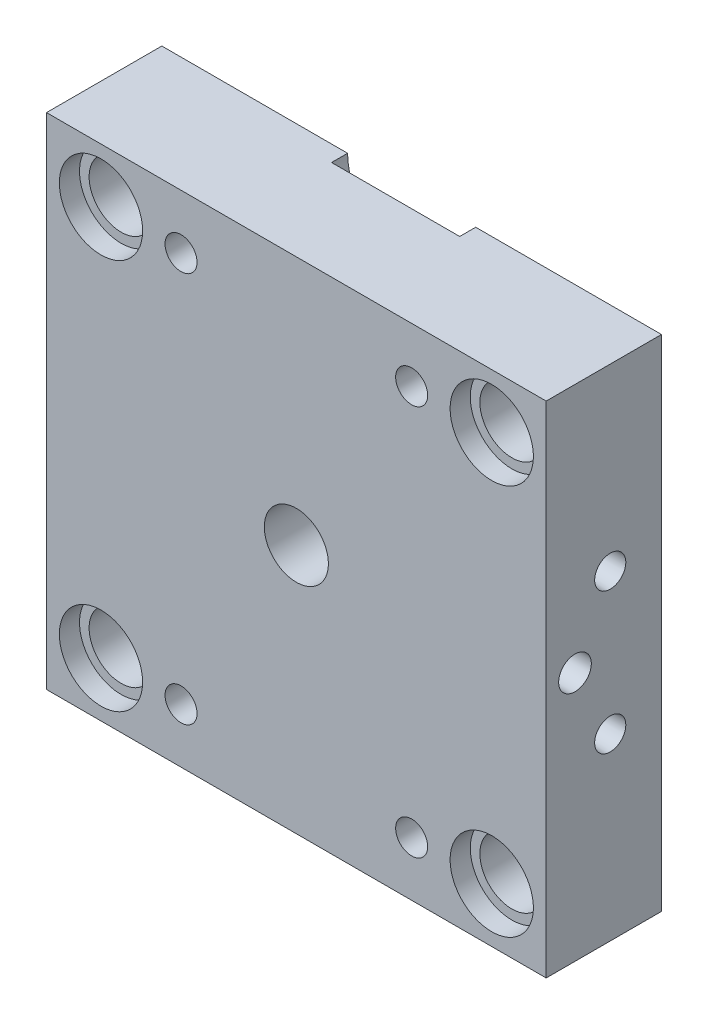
ISO-10303-21;
HEADER;
FILE_DESCRIPTION(('STEP AP214'),'2;1');
FILE_NAME('part.step','',(''),(''),'','','');
FILE_SCHEMA(('AUTOMOTIVE_DESIGN { 1 0 10303 214 1 1 1 1 }'));
ENDSEC;
DATA;
#1=APPLICATION_CONTEXT('core data for automotive mechanical design processes');
#2=APPLICATION_PROTOCOL_DEFINITION('international standard','automotive_design',2000,#1);
#3=PRODUCT_CONTEXT('',#1,'mechanical');
#4=PRODUCT('Part','Part','',(#3));
#5=PRODUCT_RELATED_PRODUCT_CATEGORY('part','',(#4));
#6=PRODUCT_DEFINITION_FORMATION('','',#4);
#7=PRODUCT_DEFINITION_CONTEXT('part definition',#1,'design');
#8=PRODUCT_DEFINITION('design','',#6,#7);
#9=PRODUCT_DEFINITION_SHAPE('','',#8);
#10=(LENGTH_UNIT() NAMED_UNIT(*) SI_UNIT(.MILLI.,.METRE.));
#11=(NAMED_UNIT(*) PLANE_ANGLE_UNIT() SI_UNIT($,.RADIAN.));
#12=(NAMED_UNIT(*) SI_UNIT($,.STERADIAN.) SOLID_ANGLE_UNIT());
#13=UNCERTAINTY_MEASURE_WITH_UNIT(LENGTH_MEASURE(1.E-05),#10,'distance_accuracy_value','');
#14=(GEOMETRIC_REPRESENTATION_CONTEXT(3) GLOBAL_UNCERTAINTY_ASSIGNED_CONTEXT((#13)) GLOBAL_UNIT_ASSIGNED_CONTEXT((#10,
#11,#12)) REPRESENTATION_CONTEXT('',''));
#15=CARTESIAN_POINT('',(0.,0.,0.));
#16=DIRECTION('',(0.,0.,1.));
#17=DIRECTION('',(1.,0.,0.));
#18=AXIS2_PLACEMENT_3D('',#15,#16,#17);
#19=CARTESIAN_POINT('',(-78.,-78.,0.));
#20=DIRECTION('',(0.,0.,1.));
#21=DIRECTION('',(1.,0.,0.));
#22=AXIS2_PLACEMENT_3D('',#19,#20,#21);
#23=PLANE('',#22);
#24=CARTESIAN_POINT('',(40.,0.,0.));
#25=DIRECTION('',(0.,0.,-1.));
#26=DIRECTION('',(-1.,0.,0.));
#27=AXIS2_PLACEMENT_3D('',#24,#25,#26);
#28=CIRCLE('',#27,14.7175);
#29=CARTESIAN_POINT('',(25.3591391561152,1.5,0.));
#30=VERTEX_POINT('',#29);
#31=CARTESIAN_POINT('',(25.3591391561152,-1.5,0.));
#32=VERTEX_POINT('',#31);
#33=EDGE_CURVE('E441',#30,#32,#28,.T.);
#34=ORIENTED_EDGE('',*,*,#33,.F.);
#35=DIRECTION('',(1.,0.,0.));
#36=VECTOR('',#35,1.);
#37=CARTESIAN_POINT('',(26.2,1.5,0.));
#38=LINE('',#37,#36);
#39=CARTESIAN_POINT('',(23.,1.5,0.));
#40=VERTEX_POINT('',#39);
#41=EDGE_CURVE('E205',#40,#30,#38,.T.);
#42=ORIENTED_EDGE('',*,*,#41,.F.);
#43=CARTESIAN_POINT('',(23.,0.,0.));
#44=DIRECTION('',(0.,0.,-1.));
#45=DIRECTION('',(1.,0.,0.));
#46=AXIS2_PLACEMENT_3D('',#43,#44,#45);
#47=CIRCLE('',#46,1.5);
#48=CARTESIAN_POINT('',(23.,-1.5,0.));
#49=VERTEX_POINT('',#48);
#50=EDGE_CURVE('E213',#49,#40,#47,.T.);
#51=ORIENTED_EDGE('',*,*,#50,.F.);
#52=DIRECTION('',(-1.,0.,0.));
#53=VECTOR('',#52,1.);
#54=CARTESIAN_POINT('',(23.,-1.5,0.));
#55=LINE('',#54,#53);
#56=EDGE_CURVE('E199',#32,#49,#55,.T.);
#57=ORIENTED_EDGE('',*,*,#56,.F.);
#58=EDGE_LOOP('',(#34,#42,#51,#57));
#59=FACE_BOUND('',#58,.T.);
#60=CARTESIAN_POINT('',(61.,-61.,0.));
#61=DIRECTION('',(0.,0.,1.));
#62=DIRECTION('',(-1.,0.,0.));
#63=AXIS2_PLACEMENT_3D('',#60,#61,#62);
#64=CIRCLE('',#63,10.);
#65=CARTESIAN_POINT('',(51.,-61.,0.));
#66=VERTEX_POINT('',#65);
#67=EDGE_CURVE('E335',#66,#66,#64,.T.);
#68=ORIENTED_EDGE('',*,*,#67,.T.);
#69=EDGE_LOOP('',(#68));
#70=FACE_BOUND('',#69,.T.);
#71=CARTESIAN_POINT('',(61.,61.,0.));
#72=DIRECTION('',(0.,0.,-1.));
#73=DIRECTION('',(-1.,0.,0.));
#74=AXIS2_PLACEMENT_3D('',#71,#72,#73);
#75=CIRCLE('',#74,10.);
#76=CARTESIAN_POINT('',(51.,61.,0.));
#77=VERTEX_POINT('',#76);
#78=EDGE_CURVE('E357',#77,#77,#75,.T.);
#79=ORIENTED_EDGE('',*,*,#78,.F.);
#80=EDGE_LOOP('',(#79));
#81=FACE_BOUND('',#80,.T.);
#82=DIRECTION('',(1.,0.,0.));
#83=VECTOR('',#82,1.);
#84=CARTESIAN_POINT('',(-78.,-78.,0.));
#85=LINE('',#84,#83);
#86=CARTESIAN_POINT('',(20.,-78.,0.));
#87=VERTEX_POINT('',#86);
#88=CARTESIAN_POINT('',(78.,-78.,0.));
#89=VERTEX_POINT('',#88);
#90=EDGE_CURVE('E396',#87,#89,#85,.T.);
#91=ORIENTED_EDGE('',*,*,#90,.F.);
#92=CARTESIAN_POINT('',(0.,-78.,0.));
#93=DIRECTION('',(0.,0.,-1.));
#94=DIRECTION('',(-1.,0.,0.));
#95=AXIS2_PLACEMENT_3D('',#92,#93,#94);
#96=CIRCLE('',#95,20.);
#97=CARTESIAN_POINT('',(-20.,-78.,0.));
#98=VERTEX_POINT('',#97);
#99=EDGE_CURVE('E270',#98,#87,#96,.T.);
#100=ORIENTED_EDGE('',*,*,#99,.F.);
#101=CARTESIAN_POINT('',(-78.,-78.,0.));
#102=VERTEX_POINT('',#101);
#103=EDGE_CURVE('E397',#102,#98,#85,.T.);
#104=ORIENTED_EDGE('',*,*,#103,.F.);
#105=DIRECTION('',(0.,-1.,0.));
#106=VECTOR('',#105,1.);
#107=CARTESIAN_POINT('',(-78.,78.,0.));
#108=LINE('',#107,#106);
#109=CARTESIAN_POINT('',(-78.,78.,0.));
#110=VERTEX_POINT('',#109);
#111=EDGE_CURVE('E382',#110,#102,#108,.T.);
#112=ORIENTED_EDGE('',*,*,#111,.F.);
#113=DIRECTION('',(-1.,0.,0.));
#114=VECTOR('',#113,1.);
#115=CARTESIAN_POINT('',(-78.,78.,0.));
#116=LINE('',#115,#114);
#117=CARTESIAN_POINT('',(-20.,78.,0.));
#118=VERTEX_POINT('',#117);
#119=EDGE_CURVE('E402',#118,#110,#116,.T.);
#120=ORIENTED_EDGE('',*,*,#119,.F.);
#121=CARTESIAN_POINT('',(0.,78.,0.));
#122=DIRECTION('',(0.,0.,-1.));
#123=DIRECTION('',(-1.,0.,0.));
#124=AXIS2_PLACEMENT_3D('',#121,#122,#123);
#125=CIRCLE('',#124,20.);
#126=CARTESIAN_POINT('',(20.,78.,0.));
#127=VERTEX_POINT('',#126);
#128=EDGE_CURVE('E280',#127,#118,#125,.T.);
#129=ORIENTED_EDGE('',*,*,#128,.F.);
#130=CARTESIAN_POINT('',(78.,78.,0.));
#131=VERTEX_POINT('',#130);
#132=EDGE_CURVE('E387',#131,#127,#116,.T.);
#133=ORIENTED_EDGE('',*,*,#132,.F.);
#134=DIRECTION('',(0.,1.,0.));
#135=VECTOR('',#134,1.);
#136=CARTESIAN_POINT('',(78.,78.,0.));
#137=LINE('',#136,#135);
#138=EDGE_CURVE('E400',#89,#131,#137,.T.);
#139=ORIENTED_EDGE('',*,*,#138,.F.);
#140=EDGE_LOOP('',(#91,#100,#104,#112,#120,#129,#133,#139));
#141=FACE_BOUND('',#140,.T.);
#142=CARTESIAN_POINT('',(-61.,61.,0.));
#143=DIRECTION('',(0.,0.,1.));
#144=DIRECTION('',(1.,0.,0.));
#145=AXIS2_PLACEMENT_3D('',#142,#143,#144);
#146=CIRCLE('',#145,10.);
#147=CARTESIAN_POINT('',(-51.,61.,0.));
#148=VERTEX_POINT('',#147);
#149=EDGE_CURVE('E379',#148,#148,#146,.T.);
#150=ORIENTED_EDGE('',*,*,#149,.T.);
#151=EDGE_LOOP('',(#150));
#152=FACE_BOUND('',#151,.T.);
#153=CARTESIAN_POINT('',(-61.,-61.,0.));
#154=DIRECTION('',(0.,0.,-1.));
#155=DIRECTION('',(1.,0.,0.));
#156=AXIS2_PLACEMENT_3D('',#153,#154,#155);
#157=CIRCLE('',#156,10.);
#158=CARTESIAN_POINT('',(-51.,-61.,0.));
#159=VERTEX_POINT('',#158);
#160=EDGE_CURVE('E313',#159,#159,#157,.T.);
#161=ORIENTED_EDGE('',*,*,#160,.F.);
#162=EDGE_LOOP('',(#161));
#163=FACE_BOUND('',#162,.T.);
#164=CARTESIAN_POINT('',(0.,0.,0.));
#165=DIRECTION('',(0.,0.,-1.));
#166=DIRECTION('',(-1.,0.,0.));
#167=AXIS2_PLACEMENT_3D('',#164,#165,#166);
#168=CIRCLE('',#167,10.);
#169=CARTESIAN_POINT('',(-10.,0.,0.));
#170=VERTEX_POINT('',#169);
#171=EDGE_CURVE('E220',#170,#170,#168,.T.);
#172=ORIENTED_EDGE('',*,*,#171,.F.);
#173=EDGE_LOOP('',(#172));
#174=FACE_BOUND('',#173,.T.);
#175=CARTESIAN_POINT('',(-40.,0.,0.));
#176=DIRECTION('',(0.,0.,-1.));
#177=DIRECTION('',(0.,1.,0.));
#178=AXIS2_PLACEMENT_3D('',#175,#176,#177);
#179=CIRCLE('',#178,14.7175);
#180=CARTESIAN_POINT('',(-25.3591391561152,-1.5,0.));
#181=VERTEX_POINT('',#180);
#182=CARTESIAN_POINT('',(-25.3591391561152,1.5,0.));
#183=VERTEX_POINT('',#182);
#184=EDGE_CURVE('E163',#181,#183,#179,.T.);
#185=ORIENTED_EDGE('',*,*,#184,.F.);
#186=DIRECTION('',(1.,0.,0.));
#187=VECTOR('',#186,1.);
#188=CARTESIAN_POINT('',(-23.,-1.5,0.));
#189=LINE('',#188,#187);
#190=CARTESIAN_POINT('',(-23.,-1.5,0.));
#191=VERTEX_POINT('',#190);
#192=EDGE_CURVE('E188',#181,#191,#189,.T.);
#193=ORIENTED_EDGE('',*,*,#192,.T.);
#194=CARTESIAN_POINT('',(-23.,0.,0.));
#195=DIRECTION('',(0.,0.,1.));
#196=DIRECTION('',(-1.,0.,0.));
#197=AXIS2_PLACEMENT_3D('',#194,#195,#196);
#198=CIRCLE('',#197,1.5);
#199=CARTESIAN_POINT('',(-23.,1.5,0.));
#200=VERTEX_POINT('',#199);
#201=EDGE_CURVE('E185',#191,#200,#198,.T.);
#202=ORIENTED_EDGE('',*,*,#201,.T.);
#203=DIRECTION('',(-1.,0.,0.));
#204=VECTOR('',#203,1.);
#205=CARTESIAN_POINT('',(-26.2,1.5,0.));
#206=LINE('',#205,#204);
#207=EDGE_CURVE('E179',#200,#183,#206,.T.);
#208=ORIENTED_EDGE('',*,*,#207,.T.);
#209=EDGE_LOOP('',(#185,#193,#202,#208));
#210=FACE_BOUND('',#209,.T.);
#211=ADVANCED_FACE('F38',(#59,#70,#81,#141,#152,#163,#174,#210),#23,.F.);
#212=CARTESIAN_POINT('',(-23.,-1.5,0.3));
#213=DIRECTION('',(0.,1.,0.));
#214=DIRECTION('',(0.,0.,1.));
#215=AXIS2_PLACEMENT_3D('',#212,#213,#214);
#216=PLANE('',#215);
#217=ORIENTED_EDGE('',*,*,#192,.F.);
#218=DIRECTION('',(0.,0.,-1.));
#219=VECTOR('',#218,1.);
#220=CARTESIAN_POINT('',(-25.3591391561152,-1.5,-65.7098157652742));
#221=LINE('',#220,#219);
#222=CARTESIAN_POINT('',(-25.3591391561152,-1.5,0.299999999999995));
#223=VERTEX_POINT('',#222);
#224=EDGE_CURVE('E167',#181,#223,#221,.F.);
#225=ORIENTED_EDGE('',*,*,#224,.T.);
#226=DIRECTION('',(1.,0.,0.));
#227=VECTOR('',#226,1.);
#228=CARTESIAN_POINT('',(-23.,-1.5,0.3));
#229=LINE('',#228,#227);
#230=CARTESIAN_POINT('',(-23.,-1.5,0.3));
#231=VERTEX_POINT('',#230);
#232=EDGE_CURVE('E192',#223,#231,#229,.T.);
#233=ORIENTED_EDGE('',*,*,#232,.T.);
#234=DIRECTION('',(0.,0.,-1.));
#235=VECTOR('',#234,1.);
#236=CARTESIAN_POINT('',(-23.,-1.5,0.3));
#237=LINE('',#236,#235);
#238=EDGE_CURVE('E196',#231,#191,#237,.T.);
#239=ORIENTED_EDGE('',*,*,#238,.T.);
#240=EDGE_LOOP('',(#217,#225,#233,#239));
#241=FACE_BOUND('',#240,.T.);
#242=ADVANCED_FACE('F459',(#241),#216,.T.);
#243=CARTESIAN_POINT('',(-26.2,1.5,0.3));
#244=DIRECTION('',(0.,-1.,0.));
#245=DIRECTION('',(0.,0.,-1.));
#246=AXIS2_PLACEMENT_3D('',#243,#244,#245);
#247=PLANE('',#246);
#248=DIRECTION('',(-1.,0.,0.));
#249=VECTOR('',#248,1.);
#250=CARTESIAN_POINT('',(-26.2,1.5,0.3));
#251=LINE('',#250,#249);
#252=CARTESIAN_POINT('',(-23.,1.5,0.3));
#253=VERTEX_POINT('',#252);
#254=CARTESIAN_POINT('',(-25.3591391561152,1.5,0.299999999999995));
#255=VERTEX_POINT('',#254);
#256=EDGE_CURVE('E182',#253,#255,#251,.T.);
#257=ORIENTED_EDGE('',*,*,#256,.T.);
#258=DIRECTION('',(0.,0.,-1.));
#259=VECTOR('',#258,1.);
#260=CARTESIAN_POINT('',(-25.3591391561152,1.5,-65.7098157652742));
#261=LINE('',#260,#259);
#262=EDGE_CURVE('E52',#255,#183,#261,.T.);
#263=ORIENTED_EDGE('',*,*,#262,.T.);
#264=ORIENTED_EDGE('',*,*,#207,.F.);
#265=DIRECTION('',(0.,0.,-1.));
#266=VECTOR('',#265,1.);
#267=CARTESIAN_POINT('',(-23.,1.5,0.3));
#268=LINE('',#267,#266);
#269=EDGE_CURVE('E200',#253,#200,#268,.T.);
#270=ORIENTED_EDGE('',*,*,#269,.F.);
#271=EDGE_LOOP('',(#257,#263,#264,#270));
#272=FACE_BOUND('',#271,.T.);
#273=ADVANCED_FACE('F177',(#272),#247,.T.);
#274=CARTESIAN_POINT('',(-23.,0.,0.3));
#275=DIRECTION('',(0.,0.,1.));
#276=DIRECTION('',(-1.,0.,0.));
#277=AXIS2_PLACEMENT_3D('',#274,#275,#276);
#278=PLANE('',#277);
#279=CARTESIAN_POINT('',(-40.,0.,0.299999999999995));
#280=DIRECTION('',(0.,0.,1.));
#281=DIRECTION('',(1.,0.,0.));
#282=AXIS2_PLACEMENT_3D('',#279,#280,#281);
#283=CIRCLE('',#282,14.7175);
#284=EDGE_CURVE('E11',#255,#223,#283,.F.);
#285=ORIENTED_EDGE('',*,*,#284,.F.);
#286=ORIENTED_EDGE('',*,*,#256,.F.);
#287=CARTESIAN_POINT('',(-23.,0.,0.3));
#288=DIRECTION('',(0.,0.,1.));
#289=DIRECTION('',(-1.,0.,0.));
#290=AXIS2_PLACEMENT_3D('',#287,#288,#289);
#291=CIRCLE('',#290,1.5);
#292=EDGE_CURVE('E453',#231,#253,#291,.T.);
#293=ORIENTED_EDGE('',*,*,#292,.F.);
#294=ORIENTED_EDGE('',*,*,#232,.F.);
#295=EDGE_LOOP('',(#285,#286,#293,#294));
#296=FACE_BOUND('',#295,.T.);
#297=ADVANCED_FACE('F462',(#296),#278,.F.);
#298=CARTESIAN_POINT('',(26.2,1.5,0.3));
#299=DIRECTION('',(0.,1.,0.));
#300=DIRECTION('',(0.,0.,1.));
#301=AXIS2_PLACEMENT_3D('',#298,#299,#300);
#302=PLANE('',#301);
#303=DIRECTION('',(0.,0.,-1.));
#304=VECTOR('',#303,1.);
#305=CARTESIAN_POINT('',(25.3591391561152,1.5,-65.7098157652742));
#306=LINE('',#305,#304);
#307=CARTESIAN_POINT('',(25.3591391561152,1.5,0.299999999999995));
#308=VERTEX_POINT('',#307);
#309=EDGE_CURVE('E186',#308,#30,#306,.T.);
#310=ORIENTED_EDGE('',*,*,#309,.F.);
#311=DIRECTION('',(1.,0.,0.));
#312=VECTOR('',#311,1.);
#313=CARTESIAN_POINT('',(26.2,1.5,0.3));
#314=LINE('',#313,#312);
#315=CARTESIAN_POINT('',(23.,1.5,0.3));
#316=VERTEX_POINT('',#315);
#317=EDGE_CURVE('E208',#316,#308,#314,.T.);
#318=ORIENTED_EDGE('',*,*,#317,.F.);
#319=DIRECTION('',(0.,0.,-1.));
#320=VECTOR('',#319,1.);
#321=CARTESIAN_POINT('',(23.,1.5,0.3));
#322=LINE('',#321,#320);
#323=EDGE_CURVE('E218',#316,#40,#322,.T.);
#324=ORIENTED_EDGE('',*,*,#323,.T.);
#325=ORIENTED_EDGE('',*,*,#41,.T.);
#326=EDGE_LOOP('',(#310,#318,#324,#325));
#327=FACE_BOUND('',#326,.T.);
#328=ADVANCED_FACE('F430',(#327),#302,.F.);
#329=CARTESIAN_POINT('',(23.,-1.5,0.3));
#330=DIRECTION('',(0.,-1.,0.));
#331=DIRECTION('',(0.,0.,-1.));
#332=AXIS2_PLACEMENT_3D('',#329,#330,#331);
#333=PLANE('',#332);
#334=DIRECTION('',(0.,0.,-1.));
#335=VECTOR('',#334,1.);
#336=CARTESIAN_POINT('',(25.3591391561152,-1.5,-65.7098157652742));
#337=LINE('',#336,#335);
#338=CARTESIAN_POINT('',(25.3591391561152,-1.5,0.299999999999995));
#339=VERTEX_POINT('',#338);
#340=EDGE_CURVE('E60',#32,#339,#337,.F.);
#341=ORIENTED_EDGE('',*,*,#340,.F.);
#342=ORIENTED_EDGE('',*,*,#56,.T.);
#343=DIRECTION('',(0.,0.,-1.));
#344=VECTOR('',#343,1.);
#345=CARTESIAN_POINT('',(23.,-1.5,0.3));
#346=LINE('',#345,#344);
#347=CARTESIAN_POINT('',(23.,-1.5,0.3));
#348=VERTEX_POINT('',#347);
#349=EDGE_CURVE('E211',#348,#49,#346,.T.);
#350=ORIENTED_EDGE('',*,*,#349,.F.);
#351=DIRECTION('',(-1.,0.,0.));
#352=VECTOR('',#351,1.);
#353=CARTESIAN_POINT('',(23.,-1.5,0.3));
#354=LINE('',#353,#352);
#355=EDGE_CURVE('E202',#339,#348,#354,.T.);
#356=ORIENTED_EDGE('',*,*,#355,.F.);
#357=EDGE_LOOP('',(#341,#342,#350,#356));
#358=FACE_BOUND('',#357,.T.);
#359=ADVANCED_FACE('F469',(#358),#333,.F.);
#360=CARTESIAN_POINT('',(23.,0.,0.3));
#361=DIRECTION('',(0.,0.,1.));
#362=DIRECTION('',(1.,0.,0.));
#363=AXIS2_PLACEMENT_3D('',#360,#361,#362);
#364=PLANE('',#363);
#365=CARTESIAN_POINT('',(40.,0.,0.299999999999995));
#366=DIRECTION('',(0.,0.,1.));
#367=DIRECTION('',(1.,0.,0.));
#368=AXIS2_PLACEMENT_3D('',#365,#366,#367);
#369=CIRCLE('',#368,14.7175);
#370=EDGE_CURVE('E46',#339,#308,#369,.F.);
#371=ORIENTED_EDGE('',*,*,#370,.F.);
#372=ORIENTED_EDGE('',*,*,#355,.T.);
#373=CARTESIAN_POINT('',(23.,0.,0.3));
#374=DIRECTION('',(0.,0.,-1.));
#375=DIRECTION('',(1.,0.,0.));
#376=AXIS2_PLACEMENT_3D('',#373,#374,#375);
#377=CIRCLE('',#376,1.5);
#378=EDGE_CURVE('E204',#348,#316,#377,.T.);
#379=ORIENTED_EDGE('',*,*,#378,.T.);
#380=ORIENTED_EDGE('',*,*,#317,.T.);
#381=EDGE_LOOP('',(#371,#372,#379,#380));
#382=FACE_BOUND('',#381,.T.);
#383=ADVANCED_FACE('F432',(#382),#364,.F.);
#384=CARTESIAN_POINT('',(-78.,-78.,36.));
#385=DIRECTION('',(0.,0.,1.));
#386=DIRECTION('',(1.,0.,0.));
#387=AXIS2_PLACEMENT_3D('',#384,#385,#386);
#388=PLANE('',#387);
#389=CARTESIAN_POINT('',(0.,0.,36.));
#390=DIRECTION('',(0.,0.,-1.));
#391=DIRECTION('',(-1.,0.,0.));
#392=AXIS2_PLACEMENT_3D('',#389,#390,#391);
#393=CIRCLE('',#392,10.);
#394=CARTESIAN_POINT('',(-10.,0.,36.));
#395=VERTEX_POINT('',#394);
#396=EDGE_CURVE('E223',#395,#395,#393,.T.);
#397=ORIENTED_EDGE('',*,*,#396,.T.);
#398=EDGE_LOOP('',(#397));
#399=FACE_BOUND('',#398,.T.);
#400=CARTESIAN_POINT('',(-36.,-61.,36.));
#401=DIRECTION('',(0.,0.,1.));
#402=DIRECTION('',(1.,0.,0.));
#403=AXIS2_PLACEMENT_3D('',#400,#401,#402);
#404=CIRCLE('',#403,5.);
#405=CARTESIAN_POINT('',(-31.,-61.,36.));
#406=VERTEX_POINT('',#405);
#407=EDGE_CURVE('E303',#406,#406,#404,.T.);
#408=ORIENTED_EDGE('',*,*,#407,.F.);
#409=EDGE_LOOP('',(#408));
#410=FACE_BOUND('',#409,.T.);
#411=CARTESIAN_POINT('',(36.,61.,36.));
#412=DIRECTION('',(0.,0.,1.));
#413=DIRECTION('',(1.,0.,0.));
#414=AXIS2_PLACEMENT_3D('',#411,#412,#413);
#415=CIRCLE('',#414,5.);
#416=CARTESIAN_POINT('',(41.,61.,36.));
#417=VERTEX_POINT('',#416);
#418=EDGE_CURVE('E347',#417,#417,#415,.T.);
#419=ORIENTED_EDGE('',*,*,#418,.F.);
#420=EDGE_LOOP('',(#419));
#421=FACE_BOUND('',#420,.T.);
#422=DIRECTION('',(0.,-1.,0.));
#423=VECTOR('',#422,1.);
#424=CARTESIAN_POINT('',(-78.,78.,36.));
#425=LINE('',#424,#423);
#426=CARTESIAN_POINT('',(-78.,78.,36.));
#427=VERTEX_POINT('',#426);
#428=CARTESIAN_POINT('',(-78.,-78.,36.));
#429=VERTEX_POINT('',#428);
#430=EDGE_CURVE('E383',#427,#429,#425,.T.);
#431=ORIENTED_EDGE('',*,*,#430,.T.);
#432=DIRECTION('',(1.,0.,0.));
#433=VECTOR('',#432,1.);
#434=CARTESIAN_POINT('',(-78.,-78.,36.));
#435=LINE('',#434,#433);
#436=CARTESIAN_POINT('',(78.,-78.,36.));
#437=VERTEX_POINT('',#436);
#438=EDGE_CURVE('E386',#429,#437,#435,.T.);
#439=ORIENTED_EDGE('',*,*,#438,.T.);
#440=DIRECTION('',(0.,1.,0.));
#441=VECTOR('',#440,1.);
#442=CARTESIAN_POINT('',(78.,78.,36.));
#443=LINE('',#442,#441);
#444=CARTESIAN_POINT('',(78.,78.,36.));
#445=VERTEX_POINT('',#444);
#446=EDGE_CURVE('E389',#437,#445,#443,.T.);
#447=ORIENTED_EDGE('',*,*,#446,.T.);
#448=DIRECTION('',(-1.,0.,0.));
#449=VECTOR('',#448,1.);
#450=CARTESIAN_POINT('',(-78.,78.,36.));
#451=LINE('',#450,#449);
#452=EDGE_CURVE('E391',#445,#427,#451,.T.);
#453=ORIENTED_EDGE('',*,*,#452,.T.);
#454=EDGE_LOOP('',(#431,#439,#447,#453));
#455=FACE_BOUND('',#454,.T.);
#456=CARTESIAN_POINT('',(-61.,61.,36.));
#457=DIRECTION('',(0.,0.,1.));
#458=DIRECTION('',(1.,0.,0.));
#459=AXIS2_PLACEMENT_3D('',#456,#457,#458);
#460=CIRCLE('',#459,13.);
#461=CARTESIAN_POINT('',(-48.,61.,36.));
#462=VERTEX_POINT('',#461);
#463=EDGE_CURVE('E372',#462,#462,#460,.T.);
#464=ORIENTED_EDGE('',*,*,#463,.F.);
#465=EDGE_LOOP('',(#464));
#466=FACE_BOUND('',#465,.T.);
#467=CARTESIAN_POINT('',(-36.,61.,36.));
#468=DIRECTION('',(0.,0.,1.));
#469=DIRECTION('',(1.,0.,0.));
#470=AXIS2_PLACEMENT_3D('',#467,#468,#469);
#471=CIRCLE('',#470,5.);
#472=CARTESIAN_POINT('',(-31.,61.,36.));
#473=VERTEX_POINT('',#472);
#474=EDGE_CURVE('E369',#473,#473,#471,.T.);
#475=ORIENTED_EDGE('',*,*,#474,.F.);
#476=EDGE_LOOP('',(#475));
#477=FACE_BOUND('',#476,.T.);
#478=CARTESIAN_POINT('',(61.,61.,36.));
#479=DIRECTION('',(0.,0.,-1.));
#480=DIRECTION('',(-1.,0.,0.));
#481=AXIS2_PLACEMENT_3D('',#478,#479,#480);
#482=CIRCLE('',#481,13.);
#483=CARTESIAN_POINT('',(48.,61.,36.));
#484=VERTEX_POINT('',#483);
#485=EDGE_CURVE('E350',#484,#484,#482,.T.);
#486=ORIENTED_EDGE('',*,*,#485,.T.);
#487=EDGE_LOOP('',(#486));
#488=FACE_BOUND('',#487,.T.);
#489=CARTESIAN_POINT('',(61.,-61.,36.));
#490=DIRECTION('',(0.,0.,1.));
#491=DIRECTION('',(-1.,0.,0.));
#492=AXIS2_PLACEMENT_3D('',#489,#490,#491);
#493=CIRCLE('',#492,13.);
#494=CARTESIAN_POINT('',(48.,-61.,36.));
#495=VERTEX_POINT('',#494);
#496=EDGE_CURVE('E328',#495,#495,#493,.T.);
#497=ORIENTED_EDGE('',*,*,#496,.F.);
#498=EDGE_LOOP('',(#497));
#499=FACE_BOUND('',#498,.T.);
#500=CARTESIAN_POINT('',(36.,-61.,36.));
#501=DIRECTION('',(0.,0.,1.));
#502=DIRECTION('',(1.,0.,0.));
#503=AXIS2_PLACEMENT_3D('',#500,#501,#502);
#504=CIRCLE('',#503,5.);
#505=CARTESIAN_POINT('',(41.,-61.,36.));
#506=VERTEX_POINT('',#505);
#507=EDGE_CURVE('E325',#506,#506,#504,.T.);
#508=ORIENTED_EDGE('',*,*,#507,.F.);
#509=EDGE_LOOP('',(#508));
#510=FACE_BOUND('',#509,.T.);
#511=CARTESIAN_POINT('',(-61.,-61.,36.));
#512=DIRECTION('',(0.,0.,-1.));
#513=DIRECTION('',(1.,0.,0.));
#514=AXIS2_PLACEMENT_3D('',#511,#512,#513);
#515=CIRCLE('',#514,13.);
#516=CARTESIAN_POINT('',(-48.,-61.,36.));
#517=VERTEX_POINT('',#516);
#518=EDGE_CURVE('E306',#517,#517,#515,.T.);
#519=ORIENTED_EDGE('',*,*,#518,.T.);
#520=EDGE_LOOP('',(#519));
#521=FACE_BOUND('',#520,.T.);
#522=ADVANCED_FACE('F481',(#399,#410,#421,#455,#466,#477,#488,#499,#510,#521),#388,.T.);
#523=CARTESIAN_POINT('',(-61.,-61.,36.));
#524=DIRECTION('',(0.,0.,-1.));
#525=DIRECTION('',(-1.,0.,0.));
#526=AXIS2_PLACEMENT_3D('',#523,#524,#525);
#527=CYLINDRICAL_SURFACE('',#526,10.);
#528=ORIENTED_EDGE('',*,*,#160,.T.);
#529=EDGE_LOOP('',(#528));
#530=FACE_BOUND('',#529,.T.);
#531=CARTESIAN_POINT('',(-61.,-61.,29.7));
#532=DIRECTION('',(0.,0.,1.));
#533=DIRECTION('',(1.,0.,0.));
#534=AXIS2_PLACEMENT_3D('',#531,#532,#533);
#535=CIRCLE('',#534,10.);
#536=CARTESIAN_POINT('',(-51.,-61.,29.7));
#537=VERTEX_POINT('',#536);
#538=EDGE_CURVE('E310',#537,#537,#535,.F.);
#539=ORIENTED_EDGE('',*,*,#538,.F.);
#540=EDGE_LOOP('',(#539));
#541=FACE_BOUND('',#540,.T.);
#542=ADVANCED_FACE('F532',(#530,#541),#527,.F.);
#543=CARTESIAN_POINT('',(61.,-61.,36.));
#544=DIRECTION('',(0.,0.,-1.));
#545=DIRECTION('',(-1.,0.,0.));
#546=AXIS2_PLACEMENT_3D('',#543,#544,#545);
#547=CYLINDRICAL_SURFACE('',#546,10.);
#548=ORIENTED_EDGE('',*,*,#67,.F.);
#549=EDGE_LOOP('',(#548));
#550=FACE_BOUND('',#549,.T.);
#551=CARTESIAN_POINT('',(61.,-61.,29.7));
#552=DIRECTION('',(0.,0.,1.));
#553=DIRECTION('',(1.,0.,0.));
#554=AXIS2_PLACEMENT_3D('',#551,#552,#553);
#555=CIRCLE('',#554,10.);
#556=CARTESIAN_POINT('',(71.,-61.,29.7));
#557=VERTEX_POINT('',#556);
#558=EDGE_CURVE('E332',#557,#557,#555,.T.);
#559=ORIENTED_EDGE('',*,*,#558,.T.);
#560=EDGE_LOOP('',(#559));
#561=FACE_BOUND('',#560,.T.);
#562=ADVANCED_FACE('F565',(#550,#561),#547,.F.);
#563=CARTESIAN_POINT('',(61.,61.,36.));
#564=DIRECTION('',(0.,0.,-1.));
#565=DIRECTION('',(-1.,0.,0.));
#566=AXIS2_PLACEMENT_3D('',#563,#564,#565);
#567=CYLINDRICAL_SURFACE('',#566,10.);
#568=ORIENTED_EDGE('',*,*,#78,.T.);
#569=EDGE_LOOP('',(#568));
#570=FACE_BOUND('',#569,.T.);
#571=CARTESIAN_POINT('',(61.,61.,29.7));
#572=DIRECTION('',(0.,0.,1.));
#573=DIRECTION('',(1.,0.,0.));
#574=AXIS2_PLACEMENT_3D('',#571,#572,#573);
#575=CIRCLE('',#574,10.);
#576=CARTESIAN_POINT('',(71.,61.,29.7));
#577=VERTEX_POINT('',#576);
#578=EDGE_CURVE('E354',#577,#577,#575,.F.);
#579=ORIENTED_EDGE('',*,*,#578,.F.);
#580=EDGE_LOOP('',(#579));
#581=FACE_BOUND('',#580,.T.);
#582=ADVANCED_FACE('F593',(#570,#581),#567,.F.);
#583=CARTESIAN_POINT('',(-61.,61.,36.));
#584=DIRECTION('',(0.,0.,-1.));
#585=DIRECTION('',(-1.,0.,0.));
#586=AXIS2_PLACEMENT_3D('',#583,#584,#585);
#587=CYLINDRICAL_SURFACE('',#586,10.);
#588=ORIENTED_EDGE('',*,*,#149,.F.);
#589=EDGE_LOOP('',(#588));
#590=FACE_BOUND('',#589,.T.);
#591=CARTESIAN_POINT('',(-61.,61.,29.7));
#592=DIRECTION('',(0.,0.,1.));
#593=DIRECTION('',(1.,0.,0.));
#594=AXIS2_PLACEMENT_3D('',#591,#592,#593);
#595=CIRCLE('',#594,10.);
#596=CARTESIAN_POINT('',(-51.,61.,29.7));
#597=VERTEX_POINT('',#596);
#598=EDGE_CURVE('E376',#597,#597,#595,.T.);
#599=ORIENTED_EDGE('',*,*,#598,.T.);
#600=EDGE_LOOP('',(#599));
#601=FACE_BOUND('',#600,.T.);
#602=ADVANCED_FACE('F497',(#590,#601),#587,.F.);
#603=CARTESIAN_POINT('',(-78.,78.,36.));
#604=DIRECTION('',(1.,0.,0.));
#605=DIRECTION('',(0.,1.,0.));
#606=AXIS2_PLACEMENT_3D('',#603,#604,#605);
#607=PLANE('',#606);
#608=CARTESIAN_POINT('',(-78.,22.,16.));
#609=DIRECTION('',(-1.,0.,0.));
#610=DIRECTION('',(0.,0.,1.));
#611=AXIS2_PLACEMENT_3D('',#608,#609,#610);
#612=CIRCLE('',#611,4.864);
#613=CARTESIAN_POINT('',(-78.,22.,20.864));
#614=VERTEX_POINT('',#613);
#615=EDGE_CURVE('E246',#614,#614,#612,.T.);
#616=ORIENTED_EDGE('',*,*,#615,.F.);
#617=EDGE_LOOP('',(#616));
#618=FACE_BOUND('',#617,.T.);
#619=CARTESIAN_POINT('',(-78.,-22.,16.));
#620=DIRECTION('',(-1.,0.,0.));
#621=DIRECTION('',(0.,0.,1.));
#622=AXIS2_PLACEMENT_3D('',#619,#620,#621);
#623=CIRCLE('',#622,4.864);
#624=CARTESIAN_POINT('',(-78.,-22.,20.864));
#625=VERTEX_POINT('',#624);
#626=EDGE_CURVE('E255',#625,#625,#623,.T.);
#627=ORIENTED_EDGE('',*,*,#626,.F.);
#628=EDGE_LOOP('',(#627));
#629=FACE_BOUND('',#628,.T.);
#630=ORIENTED_EDGE('',*,*,#111,.T.);
#631=DIRECTION('',(0.,0.,-1.));
#632=VECTOR('',#631,1.);
#633=CARTESIAN_POINT('',(-78.,-78.,36.));
#634=LINE('',#633,#632);
#635=EDGE_CURVE('E413',#429,#102,#634,.T.);
#636=ORIENTED_EDGE('',*,*,#635,.F.);
#637=ORIENTED_EDGE('',*,*,#430,.F.);
#638=DIRECTION('',(0.,0.,-1.));
#639=VECTOR('',#638,1.);
#640=CARTESIAN_POINT('',(-78.,78.,36.));
#641=LINE('',#640,#639);
#642=EDGE_CURVE('E393',#427,#110,#641,.T.);
#643=ORIENTED_EDGE('',*,*,#642,.T.);
#644=EDGE_LOOP('',(#630,#636,#637,#643));
#645=FACE_BOUND('',#644,.T.);
#646=ADVANCED_FACE('F40',(#618,#629,#645),#607,.F.);
#647=CARTESIAN_POINT('',(-78.,-78.,36.));
#648=DIRECTION('',(0.,1.,0.));
#649=DIRECTION('',(0.,0.,1.));
#650=AXIS2_PLACEMENT_3D('',#647,#648,#649);
#651=PLANE('',#650);
#652=DIRECTION('',(-1.,0.,0.));
#653=VECTOR('',#652,1.);
#654=CARTESIAN_POINT('',(20.,-78.,5.));
#655=LINE('',#654,#653);
#656=CARTESIAN_POINT('',(20.,-78.,5.));
#657=VERTEX_POINT('',#656);
#658=CARTESIAN_POINT('',(-20.,-78.,5.));
#659=VERTEX_POINT('',#658);
#660=EDGE_CURVE('E273',#657,#659,#655,.T.);
#661=ORIENTED_EDGE('',*,*,#660,.F.);
#662=DIRECTION('',(0.,0.,-1.));
#663=VECTOR('',#662,1.);
#664=CARTESIAN_POINT('',(20.,-78.,5.));
#665=LINE('',#664,#663);
#666=EDGE_CURVE('E276',#657,#87,#665,.T.);
#667=ORIENTED_EDGE('',*,*,#666,.T.);
#668=ORIENTED_EDGE('',*,*,#90,.T.);
#669=DIRECTION('',(0.,0.,-1.));
#670=VECTOR('',#669,1.);
#671=CARTESIAN_POINT('',(78.,-78.,36.));
#672=LINE('',#671,#670);
#673=EDGE_CURVE('E410',#437,#89,#672,.T.);
#674=ORIENTED_EDGE('',*,*,#673,.F.);
#675=ORIENTED_EDGE('',*,*,#438,.F.);
#676=ORIENTED_EDGE('',*,*,#635,.T.);
#677=ORIENTED_EDGE('',*,*,#103,.T.);
#678=DIRECTION('',(0.,0.,-1.));
#679=VECTOR('',#678,1.);
#680=CARTESIAN_POINT('',(-20.,-78.,5.));
#681=LINE('',#680,#679);
#682=EDGE_CURVE('E278',#659,#98,#681,.T.);
#683=ORIENTED_EDGE('',*,*,#682,.F.);
#684=EDGE_LOOP('',(#661,#667,#668,#674,#675,#676,#677,#683));
#685=FACE_BOUND('',#684,.T.);
#686=ADVANCED_FACE('F490',(#685),#651,.F.);
#687=CARTESIAN_POINT('',(78.,78.,36.));
#688=DIRECTION('',(-1.,0.,0.));
#689=DIRECTION('',(0.,0.,1.));
#690=AXIS2_PLACEMENT_3D('',#687,#688,#689);
#691=PLANE('',#690);
#692=CARTESIAN_POINT('',(78.,22.,16.));
#693=DIRECTION('',(1.,0.,0.));
#694=DIRECTION('',(0.,0.,-1.));
#695=AXIS2_PLACEMENT_3D('',#692,#693,#694);
#696=CIRCLE('',#695,4.864);
#697=CARTESIAN_POINT('',(78.,22.,11.136));
#698=VERTEX_POINT('',#697);
#699=EDGE_CURVE('E226',#698,#698,#696,.T.);
#700=ORIENTED_EDGE('',*,*,#699,.F.);
#701=EDGE_LOOP('',(#700));
#702=FACE_BOUND('',#701,.T.);
#703=CARTESIAN_POINT('',(78.,-22.,16.));
#704=DIRECTION('',(1.,0.,0.));
#705=DIRECTION('',(0.,0.,-1.));
#706=AXIS2_PLACEMENT_3D('',#703,#704,#705);
#707=CIRCLE('',#706,4.864);
#708=CARTESIAN_POINT('',(78.,-22.,11.136));
#709=VERTEX_POINT('',#708);
#710=EDGE_CURVE('E237',#709,#709,#707,.T.);
#711=ORIENTED_EDGE('',*,*,#710,.F.);
#712=EDGE_LOOP('',(#711));
#713=FACE_BOUND('',#712,.T.);
#714=CARTESIAN_POINT('',(78.,0.,27.));
#715=DIRECTION('',(1.,0.,0.));
#716=DIRECTION('',(0.,0.,-1.));
#717=AXIS2_PLACEMENT_3D('',#714,#715,#716);
#718=CIRCLE('',#717,5.09999999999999);
#719=CARTESIAN_POINT('',(78.,0.,21.9));
#720=VERTEX_POINT('',#719);
#721=EDGE_CURVE('E267',#720,#720,#718,.T.);
#722=ORIENTED_EDGE('',*,*,#721,.F.);
#723=EDGE_LOOP('',(#722));
#724=FACE_BOUND('',#723,.T.);
#725=ORIENTED_EDGE('',*,*,#138,.T.);
#726=DIRECTION('',(0.,0.,-1.));
#727=VECTOR('',#726,1.);
#728=CARTESIAN_POINT('',(78.,78.,36.));
#729=LINE('',#728,#727);
#730=EDGE_CURVE('E407',#445,#131,#729,.T.);
#731=ORIENTED_EDGE('',*,*,#730,.F.);
#732=ORIENTED_EDGE('',*,*,#446,.F.);
#733=ORIENTED_EDGE('',*,*,#673,.T.);
#734=EDGE_LOOP('',(#725,#731,#732,#733));
#735=FACE_BOUND('',#734,.T.);
#736=ADVANCED_FACE('F487',(#702,#713,#724,#735),#691,.F.);
#737=CARTESIAN_POINT('',(-78.,78.,36.));
#738=DIRECTION('',(0.,-1.,0.));
#739=DIRECTION('',(0.,0.,-1.));
#740=AXIS2_PLACEMENT_3D('',#737,#738,#739);
#741=PLANE('',#740);
#742=DIRECTION('',(1.,0.,0.));
#743=VECTOR('',#742,1.);
#744=CARTESIAN_POINT('',(20.,78.,5.));
#745=LINE('',#744,#743);
#746=CARTESIAN_POINT('',(-20.,78.,5.));
#747=VERTEX_POINT('',#746);
#748=CARTESIAN_POINT('',(20.,78.,5.));
#749=VERTEX_POINT('',#748);
#750=EDGE_CURVE('E285',#747,#749,#745,.T.);
#751=ORIENTED_EDGE('',*,*,#750,.F.);
#752=DIRECTION('',(0.,0.,-1.));
#753=VECTOR('',#752,1.);
#754=CARTESIAN_POINT('',(-20.,78.,5.));
#755=LINE('',#754,#753);
#756=EDGE_CURVE('E288',#747,#118,#755,.T.);
#757=ORIENTED_EDGE('',*,*,#756,.T.);
#758=ORIENTED_EDGE('',*,*,#119,.T.);
#759=ORIENTED_EDGE('',*,*,#642,.F.);
#760=ORIENTED_EDGE('',*,*,#452,.F.);
#761=ORIENTED_EDGE('',*,*,#730,.T.);
#762=ORIENTED_EDGE('',*,*,#132,.T.);
#763=DIRECTION('',(0.,0.,-1.));
#764=VECTOR('',#763,1.);
#765=CARTESIAN_POINT('',(20.,78.,5.));
#766=LINE('',#765,#764);
#767=EDGE_CURVE('E290',#749,#127,#766,.T.);
#768=ORIENTED_EDGE('',*,*,#767,.F.);
#769=EDGE_LOOP('',(#751,#757,#758,#759,#760,#761,#762,#768));
#770=FACE_BOUND('',#769,.T.);
#771=ADVANCED_FACE('F483',(#770),#741,.F.);
#772=CARTESIAN_POINT('',(-61.,61.,29.7));
#773=DIRECTION('',(0.,0.,1.));
#774=DIRECTION('',(1.,0.,0.));
#775=AXIS2_PLACEMENT_3D('',#772,#773,#774);
#776=CYLINDRICAL_SURFACE('',#775,13.);
#777=CARTESIAN_POINT('',(-61.,61.,29.7));
#778=DIRECTION('',(0.,0.,1.));
#779=DIRECTION('',(1.,0.,0.));
#780=AXIS2_PLACEMENT_3D('',#777,#778,#779);
#781=CIRCLE('',#780,13.);
#782=CARTESIAN_POINT('',(-48.,61.,29.7));
#783=VERTEX_POINT('',#782);
#784=EDGE_CURVE('E373',#783,#783,#781,.T.);
#785=ORIENTED_EDGE('',*,*,#784,.F.);
#786=EDGE_LOOP('',(#785));
#787=FACE_BOUND('',#786,.T.);
#788=ORIENTED_EDGE('',*,*,#463,.T.);
#789=EDGE_LOOP('',(#788));
#790=FACE_BOUND('',#789,.T.);
#791=ADVANCED_FACE('F486',(#787,#790),#776,.F.);
#792=CARTESIAN_POINT('',(-61.,61.,29.7));
#793=DIRECTION('',(0.,0.,1.));
#794=DIRECTION('',(1.,0.,0.));
#795=AXIS2_PLACEMENT_3D('',#792,#793,#794);
#796=PLANE('',#795);
#797=ORIENTED_EDGE('',*,*,#598,.F.);
#798=EDGE_LOOP('',(#797));
#799=FACE_BOUND('',#798,.T.);
#800=ORIENTED_EDGE('',*,*,#784,.T.);
#801=EDGE_LOOP('',(#800));
#802=FACE_BOUND('',#801,.T.);
#803=ADVANCED_FACE('F636',(#799,#802),#796,.T.);
#804=CARTESIAN_POINT('',(-36.,61.,36.));
#805=DIRECTION('',(0.,0.,1.));
#806=DIRECTION('',(1.,0.,0.));
#807=AXIS2_PLACEMENT_3D('',#804,#805,#806);
#808=CYLINDRICAL_SURFACE('',#807,5.);
#809=CARTESIAN_POINT('',(-36.,61.,21.));
#810=DIRECTION('',(0.,0.,1.));
#811=DIRECTION('',(1.,0.,0.));
#812=AXIS2_PLACEMENT_3D('',#809,#810,#811);
#813=CIRCLE('',#812,5.);
#814=CARTESIAN_POINT('',(-31.,61.,21.));
#815=VERTEX_POINT('',#814);
#816=EDGE_CURVE('E366',#815,#815,#813,.T.);
#817=ORIENTED_EDGE('',*,*,#816,.F.);
#818=EDGE_LOOP('',(#817));
#819=FACE_BOUND('',#818,.T.);
#820=ORIENTED_EDGE('',*,*,#474,.T.);
#821=EDGE_LOOP('',(#820));
#822=FACE_BOUND('',#821,.T.);
#823=ADVANCED_FACE('F632',(#819,#822),#808,.F.);
#824=CARTESIAN_POINT('',(-31.75,61.,21.));
#825=DIRECTION('',(0.,0.,-1.));
#826=DIRECTION('',(-1.,0.,0.));
#827=AXIS2_PLACEMENT_3D('',#824,#825,#826);
#828=PLANE('',#827);
#829=CARTESIAN_POINT('',(-36.,61.,21.));
#830=DIRECTION('',(0.,0.,1.));
#831=DIRECTION('',(1.,0.,0.));
#832=AXIS2_PLACEMENT_3D('',#829,#830,#831);
#833=CIRCLE('',#832,4.25);
#834=CARTESIAN_POINT('',(-31.75,61.,21.));
#835=VERTEX_POINT('',#834);
#836=EDGE_CURVE('E363',#835,#835,#833,.T.);
#837=ORIENTED_EDGE('',*,*,#836,.F.);
#838=EDGE_LOOP('',(#837));
#839=FACE_BOUND('',#838,.T.);
#840=ORIENTED_EDGE('',*,*,#816,.T.);
#841=EDGE_LOOP('',(#840));
#842=FACE_BOUND('',#841,.T.);
#843=ADVANCED_FACE('F628',(#839,#842),#828,.F.);
#844=CARTESIAN_POINT('',(-36.,61.,36.));
#845=DIRECTION('',(0.,0.,1.));
#846=DIRECTION('',(1.,0.,0.));
#847=AXIS2_PLACEMENT_3D('',#844,#845,#846);
#848=CYLINDRICAL_SURFACE('',#847,4.25);
#849=CARTESIAN_POINT('',(-36.,61.,16.));
#850=DIRECTION('',(0.,0.,1.));
#851=DIRECTION('',(1.,0.,0.));
#852=AXIS2_PLACEMENT_3D('',#849,#850,#851);
#853=CIRCLE('',#852,4.25);
#854=CARTESIAN_POINT('',(-31.75,61.,16.));
#855=VERTEX_POINT('',#854);
#856=EDGE_CURVE('E360',#855,#855,#853,.T.);
#857=ORIENTED_EDGE('',*,*,#856,.F.);
#858=EDGE_LOOP('',(#857));
#859=FACE_BOUND('',#858,.T.);
#860=ORIENTED_EDGE('',*,*,#836,.T.);
#861=EDGE_LOOP('',(#860));
#862=FACE_BOUND('',#861,.T.);
#863=ADVANCED_FACE('F624',(#859,#862),#848,.F.);
#864=CARTESIAN_POINT('',(-36.,61.,16.));
#865=DIRECTION('',(0.,0.,1.));
#866=DIRECTION('',(1.,0.,0.));
#867=AXIS2_PLACEMENT_3D('',#864,#865,#866);
#868=CONICAL_SURFACE('',#867,4.25,1.02974425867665);
#869=CARTESIAN_POINT('',(-36.,61.,13.4463423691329));
#870=VERTEX_POINT('',#869);
#871=VERTEX_LOOP('',#870);
#872=FACE_BOUND('',#871,.T.);
#873=ORIENTED_EDGE('',*,*,#856,.T.);
#874=EDGE_LOOP('',(#873));
#875=FACE_BOUND('',#874,.T.);
#876=ADVANCED_FACE('F614',(#872,#875),#868,.F.);
#877=CARTESIAN_POINT('',(61.,61.,29.7));
#878=DIRECTION('',(0.,0.,1.));
#879=DIRECTION('',(-1.,0.,0.));
#880=AXIS2_PLACEMENT_3D('',#877,#878,#879);
#881=PLANE('',#880);
#882=CARTESIAN_POINT('',(61.,61.,29.7));
#883=DIRECTION('',(0.,0.,-1.));
#884=DIRECTION('',(-1.,0.,0.));
#885=AXIS2_PLACEMENT_3D('',#882,#883,#884);
#886=CIRCLE('',#885,13.);
#887=CARTESIAN_POINT('',(48.,61.,29.7));
#888=VERTEX_POINT('',#887);
#889=EDGE_CURVE('E351',#888,#888,#886,.T.);
#890=ORIENTED_EDGE('',*,*,#889,.F.);
#891=EDGE_LOOP('',(#890));
#892=FACE_BOUND('',#891,.T.);
#893=ORIENTED_EDGE('',*,*,#578,.T.);
#894=EDGE_LOOP('',(#893));
#895=FACE_BOUND('',#894,.T.);
#896=ADVANCED_FACE('F611',(#892,#895),#881,.T.);
#897=CARTESIAN_POINT('',(61.,61.,29.7));
#898=DIRECTION('',(0.,0.,1.));
#899=DIRECTION('',(1.,0.,0.));
#900=AXIS2_PLACEMENT_3D('',#897,#898,#899);
#901=CYLINDRICAL_SURFACE('',#900,13.);
#902=ORIENTED_EDGE('',*,*,#889,.T.);
#903=EDGE_LOOP('',(#902));
#904=FACE_BOUND('',#903,.T.);
#905=ORIENTED_EDGE('',*,*,#485,.F.);
#906=EDGE_LOOP('',(#905));
#907=FACE_BOUND('',#906,.T.);
#908=ADVANCED_FACE('F609',(#904,#907),#901,.F.);
#909=CARTESIAN_POINT('',(36.,61.,36.));
#910=DIRECTION('',(0.,0.,1.));
#911=DIRECTION('',(1.,0.,0.));
#912=AXIS2_PLACEMENT_3D('',#909,#910,#911);
#913=CYLINDRICAL_SURFACE('',#912,5.);
#914=CARTESIAN_POINT('',(36.,61.,21.));
#915=DIRECTION('',(0.,0.,1.));
#916=DIRECTION('',(1.,0.,0.));
#917=AXIS2_PLACEMENT_3D('',#914,#915,#916);
#918=CIRCLE('',#917,5.);
#919=CARTESIAN_POINT('',(41.,61.,21.));
#920=VERTEX_POINT('',#919);
#921=EDGE_CURVE('E344',#920,#920,#918,.T.);
#922=ORIENTED_EDGE('',*,*,#921,.F.);
#923=EDGE_LOOP('',(#922));
#924=FACE_BOUND('',#923,.T.);
#925=ORIENTED_EDGE('',*,*,#418,.T.);
#926=EDGE_LOOP('',(#925));
#927=FACE_BOUND('',#926,.T.);
#928=ADVANCED_FACE('F605',(#924,#927),#913,.F.);
#929=CARTESIAN_POINT('',(40.25,61.,21.));
#930=DIRECTION('',(0.,0.,-1.));
#931=DIRECTION('',(-1.,0.,0.));
#932=AXIS2_PLACEMENT_3D('',#929,#930,#931);
#933=PLANE('',#932);
#934=CARTESIAN_POINT('',(36.,61.,21.));
#935=DIRECTION('',(0.,0.,1.));
#936=DIRECTION('',(1.,0.,0.));
#937=AXIS2_PLACEMENT_3D('',#934,#935,#936);
#938=CIRCLE('',#937,4.25);
#939=CARTESIAN_POINT('',(40.25,61.,21.));
#940=VERTEX_POINT('',#939);
#941=EDGE_CURVE('E341',#940,#940,#938,.T.);
#942=ORIENTED_EDGE('',*,*,#941,.F.);
#943=EDGE_LOOP('',(#942));
#944=FACE_BOUND('',#943,.T.);
#945=ORIENTED_EDGE('',*,*,#921,.T.);
#946=EDGE_LOOP('',(#945));
#947=FACE_BOUND('',#946,.T.);
#948=ADVANCED_FACE('F601',(#944,#947),#933,.F.);
#949=CARTESIAN_POINT('',(36.,61.,36.));
#950=DIRECTION('',(0.,0.,1.));
#951=DIRECTION('',(1.,0.,0.));
#952=AXIS2_PLACEMENT_3D('',#949,#950,#951);
#953=CYLINDRICAL_SURFACE('',#952,4.25);
#954=CARTESIAN_POINT('',(36.,61.,16.));
#955=DIRECTION('',(0.,0.,1.));
#956=DIRECTION('',(1.,0.,0.));
#957=AXIS2_PLACEMENT_3D('',#954,#955,#956);
#958=CIRCLE('',#957,4.25);
#959=CARTESIAN_POINT('',(40.25,61.,16.));
#960=VERTEX_POINT('',#959);
#961=EDGE_CURVE('E338',#960,#960,#958,.T.);
#962=ORIENTED_EDGE('',*,*,#961,.F.);
#963=EDGE_LOOP('',(#962));
#964=FACE_BOUND('',#963,.T.);
#965=ORIENTED_EDGE('',*,*,#941,.T.);
#966=EDGE_LOOP('',(#965));
#967=FACE_BOUND('',#966,.T.);
#968=ADVANCED_FACE('F597',(#964,#967),#953,.F.);
#969=CARTESIAN_POINT('',(36.,61.,16.));
#970=DIRECTION('',(0.,0.,1.));
#971=DIRECTION('',(1.,0.,0.));
#972=AXIS2_PLACEMENT_3D('',#969,#970,#971);
#973=CONICAL_SURFACE('',#972,4.25,1.02974425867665);
#974=CARTESIAN_POINT('',(36.,61.,13.4463423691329));
#975=VERTEX_POINT('',#974);
#976=VERTEX_LOOP('',#975);
#977=FACE_BOUND('',#976,.T.);
#978=ORIENTED_EDGE('',*,*,#961,.T.);
#979=EDGE_LOOP('',(#978));
#980=FACE_BOUND('',#979,.T.);
#981=ADVANCED_FACE('F589',(#977,#980),#973,.F.);
#982=CARTESIAN_POINT('',(61.,-61.,29.7));
#983=DIRECTION('',(0.,0.,1.));
#984=DIRECTION('',(1.,0.,0.));
#985=AXIS2_PLACEMENT_3D('',#982,#983,#984);
#986=CYLINDRICAL_SURFACE('',#985,13.);
#987=CARTESIAN_POINT('',(61.,-61.,29.7));
#988=DIRECTION('',(0.,0.,1.));
#989=DIRECTION('',(-1.,0.,0.));
#990=AXIS2_PLACEMENT_3D('',#987,#988,#989);
#991=CIRCLE('',#990,13.);
#992=CARTESIAN_POINT('',(48.,-61.,29.7));
#993=VERTEX_POINT('',#992);
#994=EDGE_CURVE('E329',#993,#993,#991,.T.);
#995=ORIENTED_EDGE('',*,*,#994,.F.);
#996=EDGE_LOOP('',(#995));
#997=FACE_BOUND('',#996,.T.);
#998=ORIENTED_EDGE('',*,*,#496,.T.);
#999=EDGE_LOOP('',(#998));
#1000=FACE_BOUND('',#999,.T.);
#1001=ADVANCED_FACE('F585',(#997,#1000),#986,.F.);
#1002=CARTESIAN_POINT('',(61.,-61.,29.7));
#1003=DIRECTION('',(0.,0.,1.));
#1004=DIRECTION('',(-1.,0.,0.));
#1005=AXIS2_PLACEMENT_3D('',#1002,#1003,#1004);
#1006=PLANE('',#1005);
#1007=ORIENTED_EDGE('',*,*,#558,.F.);
#1008=EDGE_LOOP('',(#1007));
#1009=FACE_BOUND('',#1008,.T.);
#1010=ORIENTED_EDGE('',*,*,#994,.T.);
#1011=EDGE_LOOP('',(#1010));
#1012=FACE_BOUND('',#1011,.T.);
#1013=ADVANCED_FACE('F581',(#1009,#1012),#1006,.T.);
#1014=CARTESIAN_POINT('',(36.,-61.,36.));
#1015=DIRECTION('',(0.,0.,1.));
#1016=DIRECTION('',(1.,0.,0.));
#1017=AXIS2_PLACEMENT_3D('',#1014,#1015,#1016);
#1018=CYLINDRICAL_SURFACE('',#1017,5.);
#1019=CARTESIAN_POINT('',(36.,-61.,21.));
#1020=DIRECTION('',(0.,0.,1.));
#1021=DIRECTION('',(1.,0.,0.));
#1022=AXIS2_PLACEMENT_3D('',#1019,#1020,#1021);
#1023=CIRCLE('',#1022,5.);
#1024=CARTESIAN_POINT('',(41.,-61.,21.));
#1025=VERTEX_POINT('',#1024);
#1026=EDGE_CURVE('E322',#1025,#1025,#1023,.T.);
#1027=ORIENTED_EDGE('',*,*,#1026,.F.);
#1028=EDGE_LOOP('',(#1027));
#1029=FACE_BOUND('',#1028,.T.);
#1030=ORIENTED_EDGE('',*,*,#507,.T.);
#1031=EDGE_LOOP('',(#1030));
#1032=FACE_BOUND('',#1031,.T.);
#1033=ADVANCED_FACE('F577',(#1029,#1032),#1018,.F.);
#1034=CARTESIAN_POINT('',(40.25,-61.,21.));
#1035=DIRECTION('',(0.,0.,-1.));
#1036=DIRECTION('',(-1.,0.,0.));
#1037=AXIS2_PLACEMENT_3D('',#1034,#1035,#1036);
#1038=PLANE('',#1037);
#1039=CARTESIAN_POINT('',(36.,-61.,21.));
#1040=DIRECTION('',(0.,0.,1.));
#1041=DIRECTION('',(1.,0.,0.));
#1042=AXIS2_PLACEMENT_3D('',#1039,#1040,#1041);
#1043=CIRCLE('',#1042,4.25);
#1044=CARTESIAN_POINT('',(40.25,-61.,21.));
#1045=VERTEX_POINT('',#1044);
#1046=EDGE_CURVE('E319',#1045,#1045,#1043,.T.);
#1047=ORIENTED_EDGE('',*,*,#1046,.F.);
#1048=EDGE_LOOP('',(#1047));
#1049=FACE_BOUND('',#1048,.T.);
#1050=ORIENTED_EDGE('',*,*,#1026,.T.);
#1051=EDGE_LOOP('',(#1050));
#1052=FACE_BOUND('',#1051,.T.);
#1053=ADVANCED_FACE('F573',(#1049,#1052),#1038,.F.);
#1054=CARTESIAN_POINT('',(36.,-61.,36.));
#1055=DIRECTION('',(0.,0.,1.));
#1056=DIRECTION('',(1.,0.,0.));
#1057=AXIS2_PLACEMENT_3D('',#1054,#1055,#1056);
#1058=CYLINDRICAL_SURFACE('',#1057,4.25);
#1059=CARTESIAN_POINT('',(36.,-61.,16.));
#1060=DIRECTION('',(0.,0.,1.));
#1061=DIRECTION('',(1.,0.,0.));
#1062=AXIS2_PLACEMENT_3D('',#1059,#1060,#1061);
#1063=CIRCLE('',#1062,4.25);
#1064=CARTESIAN_POINT('',(40.25,-61.,16.));
#1065=VERTEX_POINT('',#1064);
#1066=EDGE_CURVE('E316',#1065,#1065,#1063,.T.);
#1067=ORIENTED_EDGE('',*,*,#1066,.F.);
#1068=EDGE_LOOP('',(#1067));
#1069=FACE_BOUND('',#1068,.T.);
#1070=ORIENTED_EDGE('',*,*,#1046,.T.);
#1071=EDGE_LOOP('',(#1070));
#1072=FACE_BOUND('',#1071,.T.);
#1073=ADVANCED_FACE('F569',(#1069,#1072),#1058,.F.);
#1074=CARTESIAN_POINT('',(36.,-61.,16.));
#1075=DIRECTION('',(0.,0.,1.));
#1076=DIRECTION('',(1.,0.,0.));
#1077=AXIS2_PLACEMENT_3D('',#1074,#1075,#1076);
#1078=CONICAL_SURFACE('',#1077,4.25,1.02974425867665);
#1079=CARTESIAN_POINT('',(36.,-61.,13.4463423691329));
#1080=VERTEX_POINT('',#1079);
#1081=VERTEX_LOOP('',#1080);
#1082=FACE_BOUND('',#1081,.T.);
#1083=ORIENTED_EDGE('',*,*,#1066,.T.);
#1084=EDGE_LOOP('',(#1083));
#1085=FACE_BOUND('',#1084,.T.);
#1086=ADVANCED_FACE('F559',(#1082,#1085),#1078,.F.);
#1087=CARTESIAN_POINT('',(-61.,-61.,29.7));
#1088=DIRECTION('',(0.,0.,1.));
#1089=DIRECTION('',(1.,0.,0.));
#1090=AXIS2_PLACEMENT_3D('',#1087,#1088,#1089);
#1091=PLANE('',#1090);
#1092=CARTESIAN_POINT('',(-61.,-61.,29.7));
#1093=DIRECTION('',(0.,0.,-1.));
#1094=DIRECTION('',(1.,0.,0.));
#1095=AXIS2_PLACEMENT_3D('',#1092,#1093,#1094);
#1096=CIRCLE('',#1095,13.);
#1097=CARTESIAN_POINT('',(-48.,-61.,29.7));
#1098=VERTEX_POINT('',#1097);
#1099=EDGE_CURVE('E307',#1098,#1098,#1096,.T.);
#1100=ORIENTED_EDGE('',*,*,#1099,.F.);
#1101=EDGE_LOOP('',(#1100));
#1102=FACE_BOUND('',#1101,.T.);
#1103=ORIENTED_EDGE('',*,*,#538,.T.);
#1104=EDGE_LOOP('',(#1103));
#1105=FACE_BOUND('',#1104,.T.);
#1106=ADVANCED_FACE('F549',(#1102,#1105),#1091,.T.);
#1107=CARTESIAN_POINT('',(-61.,-61.,29.7));
#1108=DIRECTION('',(0.,0.,1.));
#1109=DIRECTION('',(1.,0.,0.));
#1110=AXIS2_PLACEMENT_3D('',#1107,#1108,#1109);
#1111=CYLINDRICAL_SURFACE('',#1110,13.);
#1112=ORIENTED_EDGE('',*,*,#1099,.T.);
#1113=EDGE_LOOP('',(#1112));
#1114=FACE_BOUND('',#1113,.T.);
#1115=ORIENTED_EDGE('',*,*,#518,.F.);
#1116=EDGE_LOOP('',(#1115));
#1117=FACE_BOUND('',#1116,.T.);
#1118=ADVANCED_FACE('F546',(#1114,#1117),#1111,.F.);
#1119=CARTESIAN_POINT('',(-36.,-61.,36.));
#1120=DIRECTION('',(0.,0.,1.));
#1121=DIRECTION('',(1.,0.,0.));
#1122=AXIS2_PLACEMENT_3D('',#1119,#1120,#1121);
#1123=CYLINDRICAL_SURFACE('',#1122,5.);
#1124=CARTESIAN_POINT('',(-36.,-61.,21.));
#1125=DIRECTION('',(0.,0.,1.));
#1126=DIRECTION('',(1.,0.,0.));
#1127=AXIS2_PLACEMENT_3D('',#1124,#1125,#1126);
#1128=CIRCLE('',#1127,5.);
#1129=CARTESIAN_POINT('',(-31.,-61.,21.));
#1130=VERTEX_POINT('',#1129);
#1131=EDGE_CURVE('E300',#1130,#1130,#1128,.T.);
#1132=ORIENTED_EDGE('',*,*,#1131,.F.);
#1133=EDGE_LOOP('',(#1132));
#1134=FACE_BOUND('',#1133,.T.);
#1135=ORIENTED_EDGE('',*,*,#407,.T.);
#1136=EDGE_LOOP('',(#1135));
#1137=FACE_BOUND('',#1136,.T.);
#1138=ADVANCED_FACE('F548',(#1134,#1137),#1123,.F.);
#1139=CARTESIAN_POINT('',(-31.75,-61.,21.));
#1140=DIRECTION('',(0.,0.,-1.));
#1141=DIRECTION('',(-1.,0.,0.));
#1142=AXIS2_PLACEMENT_3D('',#1139,#1140,#1141);
#1143=PLANE('',#1142);
#1144=CARTESIAN_POINT('',(-36.,-61.,21.));
#1145=DIRECTION('',(0.,0.,1.));
#1146=DIRECTION('',(1.,0.,0.));
#1147=AXIS2_PLACEMENT_3D('',#1144,#1145,#1146);
#1148=CIRCLE('',#1147,4.25);
#1149=CARTESIAN_POINT('',(-31.75,-61.,21.));
#1150=VERTEX_POINT('',#1149);
#1151=EDGE_CURVE('E297',#1150,#1150,#1148,.T.);
#1152=ORIENTED_EDGE('',*,*,#1151,.F.);
#1153=EDGE_LOOP('',(#1152));
#1154=FACE_BOUND('',#1153,.T.);
#1155=ORIENTED_EDGE('',*,*,#1131,.T.);
#1156=EDGE_LOOP('',(#1155));
#1157=FACE_BOUND('',#1156,.T.);
#1158=ADVANCED_FACE('F556',(#1154,#1157),#1143,.F.);
#1159=CARTESIAN_POINT('',(-36.,-61.,36.));
#1160=DIRECTION('',(0.,0.,1.));
#1161=DIRECTION('',(1.,0.,0.));
#1162=AXIS2_PLACEMENT_3D('',#1159,#1160,#1161);
#1163=CYLINDRICAL_SURFACE('',#1162,4.25);
#1164=CARTESIAN_POINT('',(-36.,-61.,16.));
#1165=DIRECTION('',(0.,0.,1.));
#1166=DIRECTION('',(1.,0.,0.));
#1167=AXIS2_PLACEMENT_3D('',#1164,#1165,#1166);
#1168=CIRCLE('',#1167,4.25);
#1169=CARTESIAN_POINT('',(-31.75,-61.,16.));
#1170=VERTEX_POINT('',#1169);
#1171=EDGE_CURVE('E292',#1170,#1170,#1168,.T.);
#1172=ORIENTED_EDGE('',*,*,#1171,.F.);
#1173=EDGE_LOOP('',(#1172));
#1174=FACE_BOUND('',#1173,.T.);
#1175=ORIENTED_EDGE('',*,*,#1151,.T.);
#1176=EDGE_LOOP('',(#1175));
#1177=FACE_BOUND('',#1176,.T.);
#1178=ADVANCED_FACE('F730',(#1174,#1177),#1163,.F.);
#1179=CARTESIAN_POINT('',(-36.,-61.,16.));
#1180=DIRECTION('',(0.,0.,1.));
#1181=DIRECTION('',(1.,0.,0.));
#1182=AXIS2_PLACEMENT_3D('',#1179,#1180,#1181);
#1183=CONICAL_SURFACE('',#1182,4.25,1.02974425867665);
#1184=CARTESIAN_POINT('',(-36.,-61.,13.4463423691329));
#1185=VERTEX_POINT('',#1184);
#1186=VERTEX_LOOP('',#1185);
#1187=FACE_BOUND('',#1186,.T.);
#1188=ORIENTED_EDGE('',*,*,#1171,.T.);
#1189=EDGE_LOOP('',(#1188));
#1190=FACE_BOUND('',#1189,.T.);
#1191=ADVANCED_FACE('F727',(#1187,#1190),#1183,.F.);
#1192=CARTESIAN_POINT('',(0.,78.,5.));
#1193=DIRECTION('',(0.,0.,-1.));
#1194=DIRECTION('',(-1.,0.,0.));
#1195=AXIS2_PLACEMENT_3D('',#1192,#1193,#1194);
#1196=CYLINDRICAL_SURFACE('',#1195,20.);
#1197=ORIENTED_EDGE('',*,*,#128,.T.);
#1198=ORIENTED_EDGE('',*,*,#756,.F.);
#1199=CARTESIAN_POINT('',(0.,78.,5.));
#1200=DIRECTION('',(0.,0.,-1.));
#1201=DIRECTION('',(-1.,0.,0.));
#1202=AXIS2_PLACEMENT_3D('',#1199,#1200,#1201);
#1203=CIRCLE('',#1202,20.);
#1204=EDGE_CURVE('E283',#749,#747,#1203,.T.);
#1205=ORIENTED_EDGE('',*,*,#1204,.F.);
#1206=ORIENTED_EDGE('',*,*,#767,.T.);
#1207=EDGE_LOOP('',(#1197,#1198,#1205,#1206));
#1208=FACE_BOUND('',#1207,.T.);
#1209=ADVANCED_FACE('F525',(#1208),#1196,.F.);
#1210=CARTESIAN_POINT('',(0.,78.,5.));
#1211=DIRECTION('',(0.,0.,-1.));
#1212=DIRECTION('',(-1.,0.,0.));
#1213=AXIS2_PLACEMENT_3D('',#1210,#1211,#1212);
#1214=PLANE('',#1213);
#1215=ORIENTED_EDGE('',*,*,#1204,.T.);
#1216=ORIENTED_EDGE('',*,*,#750,.T.);
#1217=EDGE_LOOP('',(#1215,#1216));
#1218=FACE_BOUND('',#1217,.T.);
#1219=ADVANCED_FACE('F721',(#1218),#1214,.T.);
#1220=CARTESIAN_POINT('',(0.,-78.,5.));
#1221=DIRECTION('',(0.,0.,-1.));
#1222=DIRECTION('',(-1.,0.,0.));
#1223=AXIS2_PLACEMENT_3D('',#1220,#1221,#1222);
#1224=CYLINDRICAL_SURFACE('',#1223,20.);
#1225=ORIENTED_EDGE('',*,*,#99,.T.);
#1226=ORIENTED_EDGE('',*,*,#666,.F.);
#1227=CARTESIAN_POINT('',(0.,-78.,5.));
#1228=DIRECTION('',(0.,0.,-1.));
#1229=DIRECTION('',(-1.,0.,0.));
#1230=AXIS2_PLACEMENT_3D('',#1227,#1228,#1229);
#1231=CIRCLE('',#1230,20.);
#1232=EDGE_CURVE('E271',#659,#657,#1231,.T.);
#1233=ORIENTED_EDGE('',*,*,#1232,.F.);
#1234=ORIENTED_EDGE('',*,*,#682,.T.);
#1235=EDGE_LOOP('',(#1225,#1226,#1233,#1234));
#1236=FACE_BOUND('',#1235,.T.);
#1237=ADVANCED_FACE('F506',(#1236),#1224,.F.);
#1238=CARTESIAN_POINT('',(0.,-78.,5.));
#1239=DIRECTION('',(0.,0.,-1.));
#1240=DIRECTION('',(-1.,0.,0.));
#1241=AXIS2_PLACEMENT_3D('',#1238,#1239,#1240);
#1242=PLANE('',#1241);
#1243=ORIENTED_EDGE('',*,*,#1232,.T.);
#1244=ORIENTED_EDGE('',*,*,#660,.T.);
#1245=EDGE_LOOP('',(#1243,#1244));
#1246=FACE_BOUND('',#1245,.T.);
#1247=ADVANCED_FACE('F504',(#1246),#1242,.T.);
#1248=CARTESIAN_POINT('',(78.,0.,27.));
#1249=DIRECTION('',(1.,0.,0.));
#1250=DIRECTION('',(0.,0.,-1.));
#1251=AXIS2_PLACEMENT_3D('',#1248,#1249,#1250);
#1252=CYLINDRICAL_SURFACE('',#1251,5.09999999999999);
#1253=CARTESIAN_POINT('',(53.,0.,27.));
#1254=DIRECTION('',(1.,0.,0.));
#1255=DIRECTION('',(0.,0.,-1.));
#1256=AXIS2_PLACEMENT_3D('',#1253,#1254,#1255);
#1257=CIRCLE('',#1256,5.09999999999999);
#1258=CARTESIAN_POINT('',(53.,0.,21.9));
#1259=VERTEX_POINT('',#1258);
#1260=EDGE_CURVE('E264',#1259,#1259,#1257,.T.);
#1261=ORIENTED_EDGE('',*,*,#1260,.F.);
#1262=EDGE_LOOP('',(#1261));
#1263=FACE_BOUND('',#1262,.T.);
#1264=ORIENTED_EDGE('',*,*,#721,.T.);
#1265=EDGE_LOOP('',(#1264));
#1266=FACE_BOUND('',#1265,.T.);
#1267=ADVANCED_FACE('F712',(#1263,#1266),#1252,.F.);
#1268=CARTESIAN_POINT('',(53.,0.,27.));
#1269=DIRECTION('',(1.,0.,0.));
#1270=DIRECTION('',(0.,0.,-1.));
#1271=AXIS2_PLACEMENT_3D('',#1268,#1269,#1270);
#1272=CONICAL_SURFACE('',#1271,5.09999999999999,1.02974425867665);
#1273=CARTESIAN_POINT('',(49.9356108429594,0.,27.));
#1274=VERTEX_POINT('',#1273);
#1275=VERTEX_LOOP('',#1274);
#1276=FACE_BOUND('',#1275,.T.);
#1277=ORIENTED_EDGE('',*,*,#1260,.T.);
#1278=EDGE_LOOP('',(#1277));
#1279=FACE_BOUND('',#1278,.T.);
#1280=ADVANCED_FACE('F708',(#1276,#1279),#1272,.F.);
#1281=CARTESIAN_POINT('',(-78.,-22.,16.));
#1282=DIRECTION('',(-1.,0.,0.));
#1283=DIRECTION('',(0.,0.,1.));
#1284=AXIS2_PLACEMENT_3D('',#1281,#1282,#1283);
#1285=CYLINDRICAL_SURFACE('',#1284,3.95);
#1286=CARTESIAN_POINT('',(-70.6,-22.,16.));
#1287=DIRECTION('',(-1.,0.,0.));
#1288=DIRECTION('',(0.,0.,1.));
#1289=AXIS2_PLACEMENT_3D('',#1286,#1287,#1288);
#1290=CIRCLE('',#1289,3.95000000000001);
#1291=CARTESIAN_POINT('',(-70.6,-22.,19.95));
#1292=VERTEX_POINT('',#1291);
#1293=EDGE_CURVE('E261',#1292,#1292,#1290,.T.);
#1294=ORIENTED_EDGE('',*,*,#1293,.T.);
#1295=EDGE_LOOP('',(#1294));
#1296=FACE_BOUND('',#1295,.T.);
#1297=CARTESIAN_POINT('',(70.6,-22.,16.));
#1298=DIRECTION('',(1.,0.,0.));
#1299=DIRECTION('',(0.,0.,-1.));
#1300=AXIS2_PLACEMENT_3D('',#1297,#1298,#1299);
#1301=CIRCLE('',#1300,3.95000000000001);
#1302=CARTESIAN_POINT('',(70.6,-22.,12.05));
#1303=VERTEX_POINT('',#1302);
#1304=EDGE_CURVE('E243',#1303,#1303,#1301,.T.);
#1305=ORIENTED_EDGE('',*,*,#1304,.T.);
#1306=EDGE_LOOP('',(#1305));
#1307=FACE_BOUND('',#1306,.T.);
#1308=ADVANCED_FACE('F704',(#1296,#1307),#1285,.F.);
#1309=CARTESIAN_POINT('',(-70.6,-18.05,16.));
#1310=DIRECTION('',(1.,0.,0.));
#1311=DIRECTION('',(0.,0.,-1.));
#1312=AXIS2_PLACEMENT_3D('',#1309,#1310,#1311);
#1313=PLANE('',#1312);
#1314=ORIENTED_EDGE('',*,*,#1293,.F.);
#1315=EDGE_LOOP('',(#1314));
#1316=FACE_BOUND('',#1315,.T.);
#1317=CARTESIAN_POINT('',(-70.6,-22.,16.));
#1318=DIRECTION('',(-1.,0.,0.));
#1319=DIRECTION('',(0.,0.,1.));
#1320=AXIS2_PLACEMENT_3D('',#1317,#1318,#1319);
#1321=CIRCLE('',#1320,4.63299700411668);
#1322=CARTESIAN_POINT('',(-70.6,-22.,20.6329970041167));
#1323=VERTEX_POINT('',#1322);
#1324=EDGE_CURVE('E258',#1323,#1323,#1321,.T.);
#1325=ORIENTED_EDGE('',*,*,#1324,.T.);
#1326=EDGE_LOOP('',(#1325));
#1327=FACE_BOUND('',#1326,.T.);
#1328=ADVANCED_FACE('F700',(#1316,#1327),#1313,.F.);
#1329=CARTESIAN_POINT('',(-78.,-22.,16.));
#1330=DIRECTION('',(-1.,0.,0.));
#1331=DIRECTION('',(0.,0.,1.));
#1332=AXIS2_PLACEMENT_3D('',#1329,#1330,#1331);
#1333=CONICAL_SURFACE('',#1332,4.864,0.0312064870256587);
#1334=ORIENTED_EDGE('',*,*,#1324,.F.);
#1335=EDGE_LOOP('',(#1334));
#1336=FACE_BOUND('',#1335,.T.);
#1337=ORIENTED_EDGE('',*,*,#626,.T.);
#1338=EDGE_LOOP('',(#1337));
#1339=FACE_BOUND('',#1338,.T.);
#1340=ADVANCED_FACE('F696',(#1336,#1339),#1333,.F.);
#1341=CARTESIAN_POINT('',(-78.,22.,16.));
#1342=DIRECTION('',(-1.,0.,0.));
#1343=DIRECTION('',(0.,0.,1.));
#1344=AXIS2_PLACEMENT_3D('',#1341,#1342,#1343);
#1345=CYLINDRICAL_SURFACE('',#1344,3.95);
#1346=CARTESIAN_POINT('',(-70.6,22.,16.));
#1347=DIRECTION('',(-1.,0.,0.));
#1348=DIRECTION('',(0.,0.,1.));
#1349=AXIS2_PLACEMENT_3D('',#1346,#1347,#1348);
#1350=CIRCLE('',#1349,3.95000000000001);
#1351=CARTESIAN_POINT('',(-70.6,22.,19.95));
#1352=VERTEX_POINT('',#1351);
#1353=EDGE_CURVE('E252',#1352,#1352,#1350,.T.);
#1354=ORIENTED_EDGE('',*,*,#1353,.T.);
#1355=EDGE_LOOP('',(#1354));
#1356=FACE_BOUND('',#1355,.T.);
#1357=CARTESIAN_POINT('',(70.6,22.,16.));
#1358=DIRECTION('',(1.,0.,0.));
#1359=DIRECTION('',(0.,0.,-1.));
#1360=AXIS2_PLACEMENT_3D('',#1357,#1358,#1359);
#1361=CIRCLE('',#1360,3.95000000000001);
#1362=CARTESIAN_POINT('',(70.6,22.,12.05));
#1363=VERTEX_POINT('',#1362);
#1364=EDGE_CURVE('E234',#1363,#1363,#1361,.T.);
#1365=ORIENTED_EDGE('',*,*,#1364,.T.);
#1366=EDGE_LOOP('',(#1365));
#1367=FACE_BOUND('',#1366,.T.);
#1368=ADVANCED_FACE('F692',(#1356,#1367),#1345,.F.);
#1369=CARTESIAN_POINT('',(-70.6,25.95,16.));
#1370=DIRECTION('',(1.,0.,0.));
#1371=DIRECTION('',(0.,0.,-1.));
#1372=AXIS2_PLACEMENT_3D('',#1369,#1370,#1371);
#1373=PLANE('',#1372);
#1374=ORIENTED_EDGE('',*,*,#1353,.F.);
#1375=EDGE_LOOP('',(#1374));
#1376=FACE_BOUND('',#1375,.T.);
#1377=CARTESIAN_POINT('',(-70.6,22.,16.));
#1378=DIRECTION('',(-1.,0.,0.));
#1379=DIRECTION('',(0.,0.,1.));
#1380=AXIS2_PLACEMENT_3D('',#1377,#1378,#1379);
#1381=CIRCLE('',#1380,4.63299700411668);
#1382=CARTESIAN_POINT('',(-70.6,22.,20.6329970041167));
#1383=VERTEX_POINT('',#1382);
#1384=EDGE_CURVE('E249',#1383,#1383,#1381,.T.);
#1385=ORIENTED_EDGE('',*,*,#1384,.T.);
#1386=EDGE_LOOP('',(#1385));
#1387=FACE_BOUND('',#1386,.T.);
#1388=ADVANCED_FACE('F688',(#1376,#1387),#1373,.F.);
#1389=CARTESIAN_POINT('',(-78.,22.,16.));
#1390=DIRECTION('',(-1.,0.,0.));
#1391=DIRECTION('',(0.,0.,1.));
#1392=AXIS2_PLACEMENT_3D('',#1389,#1390,#1391);
#1393=CONICAL_SURFACE('',#1392,4.864,0.0312064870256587);
#1394=ORIENTED_EDGE('',*,*,#1384,.F.);
#1395=EDGE_LOOP('',(#1394));
#1396=FACE_BOUND('',#1395,.T.);
#1397=ORIENTED_EDGE('',*,*,#615,.T.);
#1398=EDGE_LOOP('',(#1397));
#1399=FACE_BOUND('',#1398,.T.);
#1400=ADVANCED_FACE('F684',(#1396,#1399),#1393,.F.);
#1401=CARTESIAN_POINT('',(70.6,-18.05,16.));
#1402=DIRECTION('',(-1.,0.,0.));
#1403=DIRECTION('',(0.,0.,1.));
#1404=AXIS2_PLACEMENT_3D('',#1401,#1402,#1403);
#1405=PLANE('',#1404);
#1406=ORIENTED_EDGE('',*,*,#1304,.F.);
#1407=EDGE_LOOP('',(#1406));
#1408=FACE_BOUND('',#1407,.T.);
#1409=CARTESIAN_POINT('',(70.6,-22.,16.));
#1410=DIRECTION('',(1.,0.,0.));
#1411=DIRECTION('',(0.,0.,-1.));
#1412=AXIS2_PLACEMENT_3D('',#1409,#1410,#1411);
#1413=CIRCLE('',#1412,4.63299700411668);
#1414=CARTESIAN_POINT('',(70.6,-22.,11.3670029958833));
#1415=VERTEX_POINT('',#1414);
#1416=EDGE_CURVE('E240',#1415,#1415,#1413,.T.);
#1417=ORIENTED_EDGE('',*,*,#1416,.T.);
#1418=EDGE_LOOP('',(#1417));
#1419=FACE_BOUND('',#1418,.T.);
#1420=ADVANCED_FACE('F680',(#1408,#1419),#1405,.F.);
#1421=CARTESIAN_POINT('',(78.,-22.,16.));
#1422=DIRECTION('',(1.,0.,0.));
#1423=DIRECTION('',(0.,0.,-1.));
#1424=AXIS2_PLACEMENT_3D('',#1421,#1422,#1423);
#1425=CONICAL_SURFACE('',#1424,4.864,0.0312064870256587);
#1426=ORIENTED_EDGE('',*,*,#1416,.F.);
#1427=EDGE_LOOP('',(#1426));
#1428=FACE_BOUND('',#1427,.T.);
#1429=ORIENTED_EDGE('',*,*,#710,.T.);
#1430=EDGE_LOOP('',(#1429));
#1431=FACE_BOUND('',#1430,.T.);
#1432=ADVANCED_FACE('F676',(#1428,#1431),#1425,.F.);
#1433=CARTESIAN_POINT('',(70.6,25.95,16.));
#1434=DIRECTION('',(-1.,0.,0.));
#1435=DIRECTION('',(0.,0.,1.));
#1436=AXIS2_PLACEMENT_3D('',#1433,#1434,#1435);
#1437=PLANE('',#1436);
#1438=ORIENTED_EDGE('',*,*,#1364,.F.);
#1439=EDGE_LOOP('',(#1438));
#1440=FACE_BOUND('',#1439,.T.);
#1441=CARTESIAN_POINT('',(70.6,22.,16.));
#1442=DIRECTION('',(1.,0.,0.));
#1443=DIRECTION('',(0.,0.,-1.));
#1444=AXIS2_PLACEMENT_3D('',#1441,#1442,#1443);
#1445=CIRCLE('',#1444,4.63299700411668);
#1446=CARTESIAN_POINT('',(70.6,22.,11.3670029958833));
#1447=VERTEX_POINT('',#1446);
#1448=EDGE_CURVE('E231',#1447,#1447,#1445,.T.);
#1449=ORIENTED_EDGE('',*,*,#1448,.T.);
#1450=EDGE_LOOP('',(#1449));
#1451=FACE_BOUND('',#1450,.T.);
#1452=ADVANCED_FACE('F668',(#1440,#1451),#1437,.F.);
#1453=CARTESIAN_POINT('',(78.,22.,16.));
#1454=DIRECTION('',(1.,0.,0.));
#1455=DIRECTION('',(0.,0.,-1.));
#1456=AXIS2_PLACEMENT_3D('',#1453,#1454,#1455);
#1457=CONICAL_SURFACE('',#1456,4.864,0.0312064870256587);
#1458=ORIENTED_EDGE('',*,*,#1448,.F.);
#1459=EDGE_LOOP('',(#1458));
#1460=FACE_BOUND('',#1459,.T.);
#1461=ORIENTED_EDGE('',*,*,#699,.T.);
#1462=EDGE_LOOP('',(#1461));
#1463=FACE_BOUND('',#1462,.T.);
#1464=ADVANCED_FACE('F660',(#1460,#1463),#1457,.F.);
#1465=CARTESIAN_POINT('',(0.,0.,36.));
#1466=DIRECTION('',(0.,0.,-1.));
#1467=DIRECTION('',(-1.,0.,0.));
#1468=AXIS2_PLACEMENT_3D('',#1465,#1466,#1467);
#1469=CYLINDRICAL_SURFACE('',#1468,10.);
#1470=ORIENTED_EDGE('',*,*,#396,.F.);
#1471=EDGE_LOOP('',(#1470));
#1472=FACE_BOUND('',#1471,.T.);
#1473=ORIENTED_EDGE('',*,*,#171,.T.);
#1474=EDGE_LOOP('',(#1473));
#1475=FACE_BOUND('',#1474,.T.);
#1476=ADVANCED_FACE('F658',(#1472,#1475),#1469,.F.);
#1477=CARTESIAN_POINT('',(23.,0.,0.3));
#1478=DIRECTION('',(0.,0.,-1.));
#1479=DIRECTION('',(-1.,0.,0.));
#1480=AXIS2_PLACEMENT_3D('',#1477,#1478,#1479);
#1481=CYLINDRICAL_SURFACE('',#1480,1.5);
#1482=ORIENTED_EDGE('',*,*,#50,.T.);
#1483=ORIENTED_EDGE('',*,*,#323,.F.);
#1484=ORIENTED_EDGE('',*,*,#378,.F.);
#1485=ORIENTED_EDGE('',*,*,#349,.T.);
#1486=EDGE_LOOP('',(#1482,#1483,#1484,#1485));
#1487=FACE_BOUND('',#1486,.T.);
#1488=ADVANCED_FACE('F436',(#1487),#1481,.F.);
#1489=CARTESIAN_POINT('',(-23.,0.,0.3));
#1490=DIRECTION('',(0.,0.,-1.));
#1491=DIRECTION('',(-1.,0.,0.));
#1492=AXIS2_PLACEMENT_3D('',#1489,#1490,#1491);
#1493=CYLINDRICAL_SURFACE('',#1492,1.5);
#1494=ORIENTED_EDGE('',*,*,#201,.F.);
#1495=ORIENTED_EDGE('',*,*,#238,.F.);
#1496=ORIENTED_EDGE('',*,*,#292,.T.);
#1497=ORIENTED_EDGE('',*,*,#269,.T.);
#1498=EDGE_LOOP('',(#1494,#1495,#1496,#1497));
#1499=FACE_BOUND('',#1498,.T.);
#1500=ADVANCED_FACE('F461',(#1499),#1493,.F.);
#1501=CARTESIAN_POINT('',(40.,0.,7.10499999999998));
#1502=DIRECTION('',(0.,0.,1.));
#1503=DIRECTION('',(1.,0.,0.));
#1504=AXIS2_PLACEMENT_3D('',#1501,#1502,#1503);
#1505=CONICAL_SURFACE('',#1504,5.89398977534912,0.75049157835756);
#1506=CARTESIAN_POINT('',(40.,0.,4.06185493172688));
#1507=DIRECTION('',(0.,0.,1.));
#1508=DIRECTION('',(1.,0.,0.));
#1509=AXIS2_PLACEMENT_3D('',#1506,#1507,#1508);
#1510=CIRCLE('',#1509,3.056211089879);
#1511=CARTESIAN_POINT('',(43.056211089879,0.,4.06185493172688));
#1512=VERTEX_POINT('',#1511);
#1513=EDGE_CURVE('E1011',#1512,#1512,#1510,.F.);
#1514=CARTESIAN_POINT('',(40.,0.,7.10499999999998));
#1515=DIRECTION('',(0.,0.,-1.));
#1516=DIRECTION('',(-1.,0.,0.));
#1517=AXIS2_PLACEMENT_3D('',#1514,#1515,#1516);
#1518=CIRCLE('',#1517,5.89398977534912);
#1519=CARTESIAN_POINT('',(45.8939897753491,0.,7.10499999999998));
#1520=VERTEX_POINT('',#1519);
#1521=EDGE_CURVE('E442',#1520,#1520,#1518,.T.);
#1522=CARTESIAN_POINT('',(43.056211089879,0.,4.06185493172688));
#1523=CARTESIAN_POINT('',(43.0857712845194,0.,4.09355435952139));
#1524=CARTESIAN_POINT('',(43.1153314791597,0.,4.1252537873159));
#1525=CARTESIAN_POINT('',(43.1744518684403,0.,4.18865264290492));
#1526=CARTESIAN_POINT('',(43.2040120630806,0.,4.22035207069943));
#1527=CARTESIAN_POINT('',(43.2631324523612,0.,4.28375092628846));
#1528=CARTESIAN_POINT('',(43.2926926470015,0.,4.31545035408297));
#1529=CARTESIAN_POINT('',(43.3518130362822,0.,4.37884920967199));
#1530=CARTESIAN_POINT('',(43.3813732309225,0.,4.4105486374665));
#1531=CARTESIAN_POINT('',(43.4404936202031,0.,4.47394749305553));
#1532=CARTESIAN_POINT('',(43.4700538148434,0.,4.50564692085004));
#1533=CARTESIAN_POINT('',(43.5291742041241,0.,4.56904577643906));
#1534=CARTESIAN_POINT('',(43.5587343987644,0.,4.60074520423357));
#1535=CARTESIAN_POINT('',(43.617854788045,0.,4.6641440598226));
#1536=CARTESIAN_POINT('',(43.6474149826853,0.,4.69584348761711));
#1537=CARTESIAN_POINT('',(43.7065353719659,0.,4.75924234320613));
#1538=CARTESIAN_POINT('',(43.7360955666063,0.,4.79094177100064));
#1539=CARTESIAN_POINT('',(43.7952159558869,0.,4.85434062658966));
#1540=CARTESIAN_POINT('',(43.8247761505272,0.,4.88604005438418));
#1541=CARTESIAN_POINT('',(43.8838965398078,0.,4.9494389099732));
#1542=CARTESIAN_POINT('',(43.9134567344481,0.,4.98113833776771));
#1543=CARTESIAN_POINT('',(43.9725771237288,0.,5.04453719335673));
#1544=CARTESIAN_POINT('',(44.0021373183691,0.,5.07623662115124));
#1545=CARTESIAN_POINT('',(44.0612577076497,0.,5.13963547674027));
#1546=CARTESIAN_POINT('',(44.09081790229,0.,5.17133490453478));
#1547=CARTESIAN_POINT('',(44.1499382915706,0.,5.2347337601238));
#1548=CARTESIAN_POINT('',(44.179498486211,0.,5.26643318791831));
#1549=CARTESIAN_POINT('',(44.2386188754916,0.,5.32983204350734));
#1550=CARTESIAN_POINT('',(44.2681790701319,0.,5.36153147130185));
#1551=CARTESIAN_POINT('',(44.3272994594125,0.,5.42493032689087));
#1552=CARTESIAN_POINT('',(44.3568596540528,0.,5.45662975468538));
#1553=CARTESIAN_POINT('',(44.4159800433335,0.,5.5200286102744));
#1554=CARTESIAN_POINT('',(44.4455402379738,0.,5.55172803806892));
#1555=CARTESIAN_POINT('',(44.5046606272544,0.,5.61512689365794));
#1556=CARTESIAN_POINT('',(44.5342208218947,0.,5.64682632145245));
#1557=CARTESIAN_POINT('',(44.5933412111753,0.,5.71022517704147));
#1558=CARTESIAN_POINT('',(44.6229014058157,0.,5.74192460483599));
#1559=CARTESIAN_POINT('',(44.6820217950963,0.,5.80532346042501));
#1560=CARTESIAN_POINT('',(44.7115819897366,0.,5.83702288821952));
#1561=CARTESIAN_POINT('',(44.7707023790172,0.,5.90042174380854));
#1562=CARTESIAN_POINT('',(44.8002625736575,0.,5.93212117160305));
#1563=CARTESIAN_POINT('',(44.8593829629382,0.,5.99552002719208));
#1564=CARTESIAN_POINT('',(44.8889431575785,0.,6.02721945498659));
#1565=CARTESIAN_POINT('',(44.9480635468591,0.,6.09061831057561));
#1566=CARTESIAN_POINT('',(44.9776237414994,0.,6.12231773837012));
#1567=CARTESIAN_POINT('',(45.03674413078,0.,6.18571659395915));
#1568=CARTESIAN_POINT('',(45.0663043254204,0.,6.21741602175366));
#1569=CARTESIAN_POINT('',(45.125424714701,0.,6.28081487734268));
#1570=CARTESIAN_POINT('',(45.1549849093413,0.,6.31251430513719));
#1571=CARTESIAN_POINT('',(45.2141052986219,0.,6.37591316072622));
#1572=CARTESIAN_POINT('',(45.2436654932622,0.,6.40761258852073));
#1573=CARTESIAN_POINT('',(45.3027858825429,0.,6.47101144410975));
#1574=CARTESIAN_POINT('',(45.3323460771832,0.,6.50271087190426));
#1575=CARTESIAN_POINT('',(45.3914664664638,0.,6.56610972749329));
#1576=CARTESIAN_POINT('',(45.4210266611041,0.,6.5978091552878));
#1577=CARTESIAN_POINT('',(45.4801470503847,0.,6.66120801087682));
#1578=CARTESIAN_POINT('',(45.5097072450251,0.,6.69290743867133));
#1579=CARTESIAN_POINT('',(45.5688276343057,0.,6.75630629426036));
#1580=CARTESIAN_POINT('',(45.598387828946,0.,6.78800572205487));
#1581=CARTESIAN_POINT('',(45.6575082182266,0.,6.85140457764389));
#1582=CARTESIAN_POINT('',(45.6870684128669,0.,6.8831040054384));
#1583=CARTESIAN_POINT('',(45.7461888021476,0.,6.94650286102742));
#1584=CARTESIAN_POINT('',(45.7757489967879,0.,6.97820228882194));
#1585=CARTESIAN_POINT('',(45.8348693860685,0.,7.04160114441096));
#1586=CARTESIAN_POINT('',(45.8644295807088,0.,7.07330057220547));
#1587=CARTESIAN_POINT('',(45.8939897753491,0.,7.10499999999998));
#1588=B_SPLINE_CURVE_WITH_KNOTS('',3,(#1522,#1523,#1524,#1525,#1526,#1527,#1528,#1529,#1530,
#1531,#1532,#1533,#1534,#1535,#1536,#1537,#1538,#1539,#1540,#1541,#1542,#1543,#1544,#1545,#1546,
#1547,#1548,#1549,#1550,#1551,#1552,#1553,#1554,#1555,#1556,#1557,#1558,#1559,#1560,#1561,#1562,
#1563,#1564,#1565,#1566,#1567,#1568,#1569,#1570,#1571,#1572,#1573,#1574,#1575,#1576,#1577,#1578,
#1579,#1580,#1581,#1582,#1583,#1584,#1585,#1586,#1587),.UNSPECIFIED.,.F.,.F.,(4,2,2,2,2,2,2,2,2,
2,2,2,2,2,2,2,2,2,2,2,2,2,2,2,2,2,2,2,2,2,2,2,4),(0.,0.130030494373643,0.260060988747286,
0.390091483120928,0.520121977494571,0.650152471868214,0.780182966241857,0.910213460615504,
1.04024395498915,1.17027444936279,1.30030494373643,1.43033543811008,1.56036593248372,
1.69039642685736,1.820426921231,1.95045741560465,2.08048790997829,2.21051840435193,
2.34054889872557,2.47057939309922,2.60060988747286,2.7306403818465,2.86067087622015,
2.99070137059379,3.12073186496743,3.25076235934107,3.38079285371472,3.51082334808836,
3.640853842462,3.77088433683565,3.90091483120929,4.03094532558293,4.16097581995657),.UNSPECIFIED.);
#1589=EDGE_CURVE('BSEAM861',#1512,#1520,#1588,.T.);
#1590=ORIENTED_EDGE('',*,*,#1513,.F.);
#1591=ORIENTED_EDGE('',*,*,#1521,.T.);
#1592=ORIENTED_EDGE('',*,*,#1589,.T.);
#1593=ORIENTED_EDGE('',*,*,#1589,.F.);
#1594=EDGE_LOOP('',(#1590,#1592,#1591,#1593));
#1595=FACE_BOUND('',#1594,.T.);
#1596=ADVANCED_FACE('F861',(#1595),#1505,.T.);
#1597=CARTESIAN_POINT('',(40.,9.84549999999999,7.10499999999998));
#1598=DIRECTION('',(0.,0.,-1.));
#1599=DIRECTION('',(-1.,0.,0.));
#1600=AXIS2_PLACEMENT_3D('',#1597,#1598,#1599);
#1601=PLANE('',#1600);
#1602=ORIENTED_EDGE('',*,*,#1521,.F.);
#1603=EDGE_LOOP('',(#1602));
#1604=FACE_BOUND('',#1603,.T.);
#1605=CARTESIAN_POINT('',(40.,0.,7.10499999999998));
#1606=DIRECTION('',(0.,0.,-1.));
#1607=DIRECTION('',(-1.,0.,0.));
#1608=AXIS2_PLACEMENT_3D('',#1605,#1606,#1607);
#1609=CIRCLE('',#1608,9.84549999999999);
#1610=CARTESIAN_POINT('',(30.1545,0.,7.10499999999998));
#1611=VERTEX_POINT('',#1610);
#1612=EDGE_CURVE('E448',#1611,#1611,#1609,.T.);
#1613=ORIENTED_EDGE('',*,*,#1612,.T.);
#1614=EDGE_LOOP('',(#1613));
#1615=FACE_BOUND('',#1614,.T.);
#1616=ADVANCED_FACE('F919',(#1604,#1615),#1601,.T.);
#1617=CARTESIAN_POINT('',(40.,0.,7.10499999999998));
#1618=DIRECTION('',(0.,0.,-1.));
#1619=DIRECTION('',(-1.,0.,0.));
#1620=AXIS2_PLACEMENT_3D('',#1617,#1618,#1619);
#1621=CONICAL_SURFACE('',#1620,9.84549999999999,0.78539816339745);
#1622=CARTESIAN_POINT('',(40.,0.,2.23299999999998));
#1623=DIRECTION('',(0.,0.,-1.));
#1624=DIRECTION('',(-1.,0.,0.));
#1625=AXIS2_PLACEMENT_3D('',#1622,#1623,#1624);
#1626=CIRCLE('',#1625,14.7175);
#1627=CARTESIAN_POINT('',(25.2825,0.,2.23299999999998));
#1628=VERTEX_POINT('',#1627);
#1629=EDGE_CURVE('E443',#1628,#1628,#1626,.T.);
#1630=CARTESIAN_POINT('',(25.2825,0.,2.23299999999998));
#1631=CARTESIAN_POINT('',(25.33325,0.,2.28374999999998));
#1632=CARTESIAN_POINT('',(25.384,0.,2.33449999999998));
#1633=CARTESIAN_POINT('',(25.4855,0.,2.43599999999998));
#1634=CARTESIAN_POINT('',(25.53625,0.,2.48674999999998));
#1635=CARTESIAN_POINT('',(25.63775,0.,2.58824999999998));
#1636=CARTESIAN_POINT('',(25.6885,0.,2.63899999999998));
#1637=CARTESIAN_POINT('',(25.79,0.,2.74049999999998));
#1638=CARTESIAN_POINT('',(25.84075,0.,2.79124999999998));
#1639=CARTESIAN_POINT('',(25.94225,0.,2.89274999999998));
#1640=CARTESIAN_POINT('',(25.993,0.,2.94349999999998));
#1641=CARTESIAN_POINT('',(26.0945,0.,3.04499999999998));
#1642=CARTESIAN_POINT('',(26.14525,0.,3.09574999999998));
#1643=CARTESIAN_POINT('',(26.24675,0.,3.19724999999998));
#1644=CARTESIAN_POINT('',(26.2975,0.,3.24799999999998));
#1645=CARTESIAN_POINT('',(26.399,0.,3.34949999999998));
#1646=CARTESIAN_POINT('',(26.44975,0.,3.40024999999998));
#1647=CARTESIAN_POINT('',(26.55125,0.,3.50174999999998));
#1648=CARTESIAN_POINT('',(26.602,0.,3.55249999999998));
#1649=CARTESIAN_POINT('',(26.7035,0.,3.65399999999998));
#1650=CARTESIAN_POINT('',(26.75425,0.,3.70474999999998));
#1651=CARTESIAN_POINT('',(26.85575,0.,3.80624999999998));
#1652=CARTESIAN_POINT('',(26.9065,0.,3.85699999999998));
#1653=CARTESIAN_POINT('',(27.008,0.,3.95849999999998));
#1654=CARTESIAN_POINT('',(27.05875,0.,4.00924999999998));
#1655=CARTESIAN_POINT('',(27.16025,0.,4.11074999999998));
#1656=CARTESIAN_POINT('',(27.211,0.,4.16149999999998));
#1657=CARTESIAN_POINT('',(27.3125,0.,4.26299999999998));
#1658=CARTESIAN_POINT('',(27.36325,0.,4.31374999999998));
#1659=CARTESIAN_POINT('',(27.46475,0.,4.41524999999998));
#1660=CARTESIAN_POINT('',(27.5155,0.,4.46599999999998));
#1661=CARTESIAN_POINT('',(27.617,0.,4.56749999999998));
#1662=CARTESIAN_POINT('',(27.66775,0.,4.61824999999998));
#1663=CARTESIAN_POINT('',(27.76925,0.,4.71974999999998));
#1664=CARTESIAN_POINT('',(27.82,0.,4.77049999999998));
#1665=CARTESIAN_POINT('',(27.9215,0.,4.87199999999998));
#1666=CARTESIAN_POINT('',(27.97225,0.,4.92274999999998));
#1667=CARTESIAN_POINT('',(28.07375,0.,5.02424999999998));
#1668=CARTESIAN_POINT('',(28.1245,0.,5.07499999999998));
#1669=CARTESIAN_POINT('',(28.226,0.,5.17649999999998));
#1670=CARTESIAN_POINT('',(28.27675,0.,5.22724999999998));
#1671=CARTESIAN_POINT('',(28.37825,0.,5.32874999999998));
#1672=CARTESIAN_POINT('',(28.429,0.,5.37949999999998));
#1673=CARTESIAN_POINT('',(28.5305,0.,5.48099999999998));
#1674=CARTESIAN_POINT('',(28.58125,0.,5.53174999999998));
#1675=CARTESIAN_POINT('',(28.68275,0.,5.63324999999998));
#1676=CARTESIAN_POINT('',(28.7335,0.,5.68399999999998));
#1677=CARTESIAN_POINT('',(28.835,0.,5.78549999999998));
#1678=CARTESIAN_POINT('',(28.88575,0.,5.83624999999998));
#1679=CARTESIAN_POINT('',(28.98725,0.,5.93774999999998));
#1680=CARTESIAN_POINT('',(29.038,0.,5.98849999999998));
#1681=CARTESIAN_POINT('',(29.1395,0.,6.08999999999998));
#1682=CARTESIAN_POINT('',(29.19025,0.,6.14074999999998));
#1683=CARTESIAN_POINT('',(29.29175,0.,6.24224999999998));
#1684=CARTESIAN_POINT('',(29.3425,0.,6.29299999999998));
#1685=CARTESIAN_POINT('',(29.444,0.,6.39449999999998));
#1686=CARTESIAN_POINT('',(29.49475,0.,6.44524999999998));
#1687=CARTESIAN_POINT('',(29.59625,0.,6.54674999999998));
#1688=CARTESIAN_POINT('',(29.647,0.,6.59749999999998));
#1689=CARTESIAN_POINT('',(29.7485,0.,6.69899999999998));
#1690=CARTESIAN_POINT('',(29.79925,0.,6.74974999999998));
#1691=CARTESIAN_POINT('',(29.90075,0.,6.85124999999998));
#1692=CARTESIAN_POINT('',(29.9515,0.,6.90199999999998));
#1693=CARTESIAN_POINT('',(30.053,0.,7.00349999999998));
#1694=CARTESIAN_POINT('',(30.10375,0.,7.05424999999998));
#1695=CARTESIAN_POINT('',(30.1545,0.,7.10499999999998));
#1696=B_SPLINE_CURVE_WITH_KNOTS('',3,(#1630,#1631,#1632,#1633,#1634,#1635,#1636,#1637,#1638,
#1639,#1640,#1641,#1642,#1643,#1644,#1645,#1646,#1647,#1648,#1649,#1650,#1651,#1652,#1653,#1654,
#1655,#1656,#1657,#1658,#1659,#1660,#1661,#1662,#1663,#1664,#1665,#1666,#1667,#1668,#1669,#1670,
#1671,#1672,#1673,#1674,#1675,#1676,#1677,#1678,#1679,#1680,#1681,#1682,#1683,#1684,#1685,#1686,
#1687,#1688,#1689,#1690,#1691,#1692,#1693,#1694,#1695),.UNSPECIFIED.,.F.,.F.,(4,2,2,2,2,2,2,2,2,
2,2,2,2,2,2,2,2,2,2,2,2,2,2,2,2,2,2,2,2,2,2,2,4),(0.,0.215314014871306,0.430628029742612,
0.645942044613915,0.861256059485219,1.07657007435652,1.29188408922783,1.50719810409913,
1.72251211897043,1.93782613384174,2.15314014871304,2.36845416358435,2.58376817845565,
2.79908219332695,3.01439620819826,3.22971022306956,3.44502423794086,3.66033825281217,
3.87565226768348,4.09096628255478,4.30628029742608,4.52159431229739,4.73690832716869,
4.95222234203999,5.1675363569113,5.3828503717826,5.59816438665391,5.81347840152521,
6.02879241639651,6.24410643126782,6.45942044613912,6.67473446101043,6.89004847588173),.UNSPECIFIED.);
#1697=EDGE_CURVE('BSEAM928',#1628,#1611,#1696,.T.);
#1698=ORIENTED_EDGE('',*,*,#1629,.T.);
#1699=ORIENTED_EDGE('',*,*,#1612,.F.);
#1700=ORIENTED_EDGE('',*,*,#1697,.T.);
#1701=ORIENTED_EDGE('',*,*,#1697,.F.);
#1702=EDGE_LOOP('',(#1698,#1700,#1699,#1701));
#1703=FACE_BOUND('',#1702,.T.);
#1704=ADVANCED_FACE('F928',(#1703),#1621,.F.);
#1705=CARTESIAN_POINT('',(40.,0.,-65.7098157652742));
#1706=DIRECTION('',(0.,0.,-1.));
#1707=DIRECTION('',(-1.,0.,0.));
#1708=AXIS2_PLACEMENT_3D('',#1705,#1706,#1707);
#1709=CYLINDRICAL_SURFACE('',#1708,14.7175);
#1710=ORIENTED_EDGE('',*,*,#1629,.F.);
#1711=EDGE_LOOP('',(#1710));
#1712=FACE_BOUND('',#1711,.T.);
#1713=ORIENTED_EDGE('',*,*,#309,.T.);
#1714=ORIENTED_EDGE('',*,*,#33,.T.);
#1715=ORIENTED_EDGE('',*,*,#340,.T.);
#1716=ORIENTED_EDGE('',*,*,#370,.T.);
#1717=EDGE_LOOP('',(#1713,#1714,#1715,#1716));
#1718=FACE_BOUND('',#1717,.T.);
#1719=ADVANCED_FACE('F424',(#1712,#1718),#1709,.F.);
#1720=CARTESIAN_POINT('',(-40.,0.,7.105));
#1721=DIRECTION('',(0.,0.,1.));
#1722=DIRECTION('',(0.,-1.,0.));
#1723=AXIS2_PLACEMENT_3D('',#1720,#1721,#1722);
#1724=CONICAL_SURFACE('',#1723,5.89398977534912,0.75049157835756);
#1725=CARTESIAN_POINT('',(-40.,0.,4.06185493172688));
#1726=DIRECTION('',(0.,0.,1.));
#1727=DIRECTION('',(1.,0.,0.));
#1728=AXIS2_PLACEMENT_3D('',#1725,#1726,#1727);
#1729=CIRCLE('',#1728,3.05621108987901);
#1730=CARTESIAN_POINT('',(-40.,-3.05621108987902,4.06185493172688));
#1731=VERTEX_POINT('',#1730);
#1732=EDGE_CURVE('E1012',#1731,#1731,#1729,.F.);
#1733=CARTESIAN_POINT('',(-40.,0.,7.105));
#1734=DIRECTION('',(0.,0.,-1.));
#1735=DIRECTION('',(0.,1.,0.));
#1736=AXIS2_PLACEMENT_3D('',#1733,#1734,#1735);
#1737=CIRCLE('',#1736,5.89398977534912);
#1738=CARTESIAN_POINT('',(-40.,-5.89398977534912,7.105));
#1739=VERTEX_POINT('',#1738);
#1740=EDGE_CURVE('E171',#1739,#1739,#1737,.T.);
#1741=CARTESIAN_POINT('',(-40.,-3.05621108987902,4.06185493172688));
#1742=CARTESIAN_POINT('',(-40.,-3.08577128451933,4.09355435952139));
#1743=CARTESIAN_POINT('',(-40.,-3.11533147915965,4.1252537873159));
#1744=CARTESIAN_POINT('',(-40.,-3.17445186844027,4.18865264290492));
#1745=CARTESIAN_POINT('',(-40.,-3.20401206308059,4.22035207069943));
#1746=CARTESIAN_POINT('',(-40.,-3.26313245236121,4.28375092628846));
#1747=CARTESIAN_POINT('',(-40.,-3.29269264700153,4.31545035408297));
#1748=CARTESIAN_POINT('',(-40.,-3.35181303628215,4.37884920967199));
#1749=CARTESIAN_POINT('',(-40.,-3.38137323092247,4.4105486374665));
#1750=CARTESIAN_POINT('',(-40.,-3.4404936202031,4.47394749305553));
#1751=CARTESIAN_POINT('',(-40.,-3.47005381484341,4.50564692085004));
#1752=CARTESIAN_POINT('',(-40.,-3.52917420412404,4.56904577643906));
#1753=CARTESIAN_POINT('',(-40.,-3.55873439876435,4.60074520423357));
#1754=CARTESIAN_POINT('',(-40.,-3.61785478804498,4.6641440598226));
#1755=CARTESIAN_POINT('',(-40.,-3.64741498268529,4.69584348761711));
#1756=CARTESIAN_POINT('',(-40.,-3.70653537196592,4.75924234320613));
#1757=CARTESIAN_POINT('',(-40.,-3.73609556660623,4.79094177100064));
#1758=CARTESIAN_POINT('',(-40.,-3.79521595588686,4.85434062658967));
#1759=CARTESIAN_POINT('',(-40.,-3.82477615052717,4.88604005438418));
#1760=CARTESIAN_POINT('',(-40.,-3.8838965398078,4.9494389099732));
#1761=CARTESIAN_POINT('',(-40.,-3.91345673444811,4.98113833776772));
#1762=CARTESIAN_POINT('',(-40.,-3.97257712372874,5.04453719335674));
#1763=CARTESIAN_POINT('',(-40.,-4.00213731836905,5.07623662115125));
#1764=CARTESIAN_POINT('',(-40.,-4.06125770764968,5.13963547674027));
#1765=CARTESIAN_POINT('',(-40.,-4.09081790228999,5.17133490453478));
#1766=CARTESIAN_POINT('',(-40.,-4.14993829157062,5.23473376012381));
#1767=CARTESIAN_POINT('',(-40.,-4.17949848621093,5.26643318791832));
#1768=CARTESIAN_POINT('',(-40.,-4.23861887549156,5.32983204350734));
#1769=CARTESIAN_POINT('',(-40.,-4.26817907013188,5.36153147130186));
#1770=CARTESIAN_POINT('',(-40.,-4.3272994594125,5.42493032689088));
#1771=CARTESIAN_POINT('',(-40.,-4.35685965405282,5.45662975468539));
#1772=CARTESIAN_POINT('',(-40.,-4.41598004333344,5.52002861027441));
#1773=CARTESIAN_POINT('',(-40.,-4.44554023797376,5.55172803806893));
#1774=CARTESIAN_POINT('',(-40.,-4.50466062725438,5.61512689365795));
#1775=CARTESIAN_POINT('',(-40.,-4.5342208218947,5.64682632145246));
#1776=CARTESIAN_POINT('',(-40.,-4.59334121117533,5.71022517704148));
#1777=CARTESIAN_POINT('',(-40.,-4.62290140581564,5.741924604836));
#1778=CARTESIAN_POINT('',(-40.,-4.68202179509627,5.80532346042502));
#1779=CARTESIAN_POINT('',(-40.,-4.71158198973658,5.83702288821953));
#1780=CARTESIAN_POINT('',(-40.,-4.77070237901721,5.90042174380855));
#1781=CARTESIAN_POINT('',(-40.,-4.80026257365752,5.93212117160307));
#1782=CARTESIAN_POINT('',(-40.,-4.85938296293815,5.99552002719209));
#1783=CARTESIAN_POINT('',(-40.,-4.88894315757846,6.0272194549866));
#1784=CARTESIAN_POINT('',(-40.,-4.94806354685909,6.09061831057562));
#1785=CARTESIAN_POINT('',(-40.,-4.9776237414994,6.12231773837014));
#1786=CARTESIAN_POINT('',(-40.,-5.03674413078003,6.18571659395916));
#1787=CARTESIAN_POINT('',(-40.,-5.06630432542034,6.21741602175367));
#1788=CARTESIAN_POINT('',(-40.,-5.12542471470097,6.28081487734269));
#1789=CARTESIAN_POINT('',(-40.,-5.15498490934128,6.31251430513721));
#1790=CARTESIAN_POINT('',(-40.,-5.21410529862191,6.37591316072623));
#1791=CARTESIAN_POINT('',(-40.,-5.24366549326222,6.40761258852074));
#1792=CARTESIAN_POINT('',(-40.,-5.30278588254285,6.47101144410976));
#1793=CARTESIAN_POINT('',(-40.,-5.33234607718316,6.50271087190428));
#1794=CARTESIAN_POINT('',(-40.,-5.39146646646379,6.5661097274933));
#1795=CARTESIAN_POINT('',(-40.,-5.42102666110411,6.59780915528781));
#1796=CARTESIAN_POINT('',(-40.,-5.48014705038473,6.66120801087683));
#1797=CARTESIAN_POINT('',(-40.,-5.50970724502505,6.69290743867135));
#1798=CARTESIAN_POINT('',(-40.,-5.56882763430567,6.75630629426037));
#1799=CARTESIAN_POINT('',(-40.,-5.59838782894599,6.78800572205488));
#1800=CARTESIAN_POINT('',(-40.,-5.65750821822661,6.8514045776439));
#1801=CARTESIAN_POINT('',(-40.,-5.68706841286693,6.88310400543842));
#1802=CARTESIAN_POINT('',(-40.,-5.74618880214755,6.94650286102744));
#1803=CARTESIAN_POINT('',(-40.,-5.77574899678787,6.97820228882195));
#1804=CARTESIAN_POINT('',(-40.,-5.8348693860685,7.04160114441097));
#1805=CARTESIAN_POINT('',(-40.,-5.86442958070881,7.07330057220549));
#1806=CARTESIAN_POINT('',(-40.,-5.89398977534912,7.105));
#1807=B_SPLINE_CURVE_WITH_KNOTS('',3,(#1741,#1742,#1743,#1744,#1745,#1746,#1747,#1748,#1749,
#1750,#1751,#1752,#1753,#1754,#1755,#1756,#1757,#1758,#1759,#1760,#1761,#1762,#1763,#1764,#1765,
#1766,#1767,#1768,#1769,#1770,#1771,#1772,#1773,#1774,#1775,#1776,#1777,#1778,#1779,#1780,#1781,
#1782,#1783,#1784,#1785,#1786,#1787,#1788,#1789,#1790,#1791,#1792,#1793,#1794,#1795,#1796,#1797,
#1798,#1799,#1800,#1801,#1802,#1803,#1804,#1805,#1806),.UNSPECIFIED.,.F.,.F.,(4,2,2,2,2,2,2,2,2,
2,2,2,2,2,2,2,2,2,2,2,2,2,2,2,2,2,2,2,2,2,2,2,4),(0.,0.130030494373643,0.260060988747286,
0.39009148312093,0.520121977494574,0.650152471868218,0.780182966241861,0.910213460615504,
1.04024395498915,1.17027444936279,1.30030494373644,1.43033543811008,1.56036593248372,
1.69039642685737,1.82042692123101,1.95045741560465,2.0804879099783,2.21051840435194,
2.34054889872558,2.47057939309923,2.60060988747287,2.73064038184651,2.86067087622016,
2.9907013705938,3.12073186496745,3.25076235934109,3.38079285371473,3.51082334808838,
3.64085384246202,3.77088433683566,3.90091483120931,4.03094532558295,4.1609758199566),.UNSPECIFIED.);
#1808=EDGE_CURVE('BSEAM947',#1731,#1739,#1807,.T.);
#1809=ORIENTED_EDGE('',*,*,#1732,.F.);
#1810=ORIENTED_EDGE('',*,*,#1740,.T.);
#1811=ORIENTED_EDGE('',*,*,#1808,.T.);
#1812=ORIENTED_EDGE('',*,*,#1808,.F.);
#1813=EDGE_LOOP('',(#1809,#1811,#1810,#1812));
#1814=FACE_BOUND('',#1813,.T.);
#1815=ADVANCED_FACE('F947',(#1814),#1724,.T.);
#1816=CARTESIAN_POINT('',(-30.1545,0.,7.105));
#1817=DIRECTION('',(0.,0.,-1.));
#1818=DIRECTION('',(0.,1.,0.));
#1819=AXIS2_PLACEMENT_3D('',#1816,#1817,#1818);
#1820=PLANE('',#1819);
#1821=ORIENTED_EDGE('',*,*,#1740,.F.);
#1822=EDGE_LOOP('',(#1821));
#1823=FACE_BOUND('',#1822,.T.);
#1824=CARTESIAN_POINT('',(-40.,0.,7.10499999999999));
#1825=DIRECTION('',(0.,0.,-1.));
#1826=DIRECTION('',(0.,1.,0.));
#1827=AXIS2_PLACEMENT_3D('',#1824,#1825,#1826);
#1828=CIRCLE('',#1827,9.84549999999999);
#1829=CARTESIAN_POINT('',(-40.,9.84549999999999,7.10499999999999));
#1830=VERTEX_POINT('',#1829);
#1831=EDGE_CURVE('E1015',#1830,#1830,#1828,.T.);
#1832=ORIENTED_EDGE('',*,*,#1831,.T.);
#1833=EDGE_LOOP('',(#1832));
#1834=FACE_BOUND('',#1833,.T.);
#1835=ADVANCED_FACE('F957',(#1823,#1834),#1820,.T.);
#1836=CARTESIAN_POINT('',(-40.,0.,7.10499999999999));
#1837=DIRECTION('',(0.,0.,-1.));
#1838=DIRECTION('',(0.,1.,0.));
#1839=AXIS2_PLACEMENT_3D('',#1836,#1837,#1838);
#1840=CONICAL_SURFACE('',#1839,9.84549999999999,0.78539816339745);
#1841=CARTESIAN_POINT('',(-40.,0.,2.23299999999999));
#1842=DIRECTION('',(0.,0.,-1.));
#1843=DIRECTION('',(0.,1.,0.));
#1844=AXIS2_PLACEMENT_3D('',#1841,#1842,#1843);
#1845=CIRCLE('',#1844,14.7175);
#1846=CARTESIAN_POINT('',(-40.,14.7175,2.23299999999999));
#1847=VERTEX_POINT('',#1846);
#1848=EDGE_CURVE('E172',#1847,#1847,#1845,.T.);
#1849=ORIENTED_EDGE('',*,*,#1848,.T.);
#1850=EDGE_LOOP('',(#1849));
#1851=FACE_BOUND('',#1850,.T.);
#1852=ORIENTED_EDGE('',*,*,#1831,.F.);
#1853=EDGE_LOOP('',(#1852));
#1854=FACE_BOUND('',#1853,.T.);
#1855=ADVANCED_FACE('F967',(#1851,#1854),#1840,.F.);
#1856=CARTESIAN_POINT('',(-40.,0.,-65.7098157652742));
#1857=DIRECTION('',(0.,0.,-1.));
#1858=DIRECTION('',(0.,1.,0.));
#1859=AXIS2_PLACEMENT_3D('',#1856,#1857,#1858);
#1860=CYLINDRICAL_SURFACE('',#1859,14.7175);
#1861=ORIENTED_EDGE('',*,*,#184,.T.);
#1862=ORIENTED_EDGE('',*,*,#262,.F.);
#1863=ORIENTED_EDGE('',*,*,#284,.T.);
#1864=ORIENTED_EDGE('',*,*,#224,.F.);
#1865=EDGE_LOOP('',(#1861,#1862,#1863,#1864));
#1866=FACE_BOUND('',#1865,.T.);
#1867=ORIENTED_EDGE('',*,*,#1848,.F.);
#1868=EDGE_LOOP('',(#1867));
#1869=FACE_BOUND('',#1868,.T.);
#1870=ADVANCED_FACE('F164',(#1866,#1869),#1860,.F.);
#1871=CARTESIAN_POINT('',(0.,0.,4.06185493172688));
#1872=DIRECTION('',(0.,0.,1.));
#1873=DIRECTION('',(1.,0.,0.));
#1874=AXIS2_PLACEMENT_3D('',#1871,#1872,#1873);
#1875=PLANE('',#1874);
#1876=ORIENTED_EDGE('',*,*,#1732,.T.);
#1877=EDGE_LOOP('',(#1876));
#1878=FACE_BOUND('',#1877,.T.);
#1879=ADVANCED_FACE('F986',(#1878),#1875,.F.);
#1880=CARTESIAN_POINT('',(0.,0.,4.06185493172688));
#1881=DIRECTION('',(0.,0.,1.));
#1882=DIRECTION('',(1.,0.,0.));
#1883=AXIS2_PLACEMENT_3D('',#1880,#1881,#1882);
#1884=PLANE('',#1883);
#1885=ORIENTED_EDGE('',*,*,#1513,.T.);
#1886=EDGE_LOOP('',(#1885));
#1887=FACE_BOUND('',#1886,.T.);
#1888=ADVANCED_FACE('F995',(#1887),#1884,.F.);
#1889=CLOSED_SHELL('',(#211,#242,#273,#297,#328,#359,#383,#522,#542,#562,#582,#602,#646,#686,
#736,#771,#791,#803,#823,#843,#863,#876,#896,#908,#928,#948,#968,#981,#1001,#1013,#1033,#1053,
#1073,#1086,#1106,#1118,#1138,#1158,#1178,#1191,#1209,#1219,#1237,#1247,#1267,#1280,#1308,#1328,
#1340,#1368,#1388,#1400,#1420,#1432,#1452,#1464,#1476,#1488,#1500,#1596,#1616,#1704,#1719,#1815,
#1835,#1855,#1870,#1879,#1888));
#1890=MANIFOLD_SOLID_BREP('B2',#1889);
#1891=ADVANCED_BREP_SHAPE_REPRESENTATION('',(#18,#1890),#14);
#1892=SHAPE_DEFINITION_REPRESENTATION(#9,#1891);
ENDSEC;
END-ISO-10303-21;
